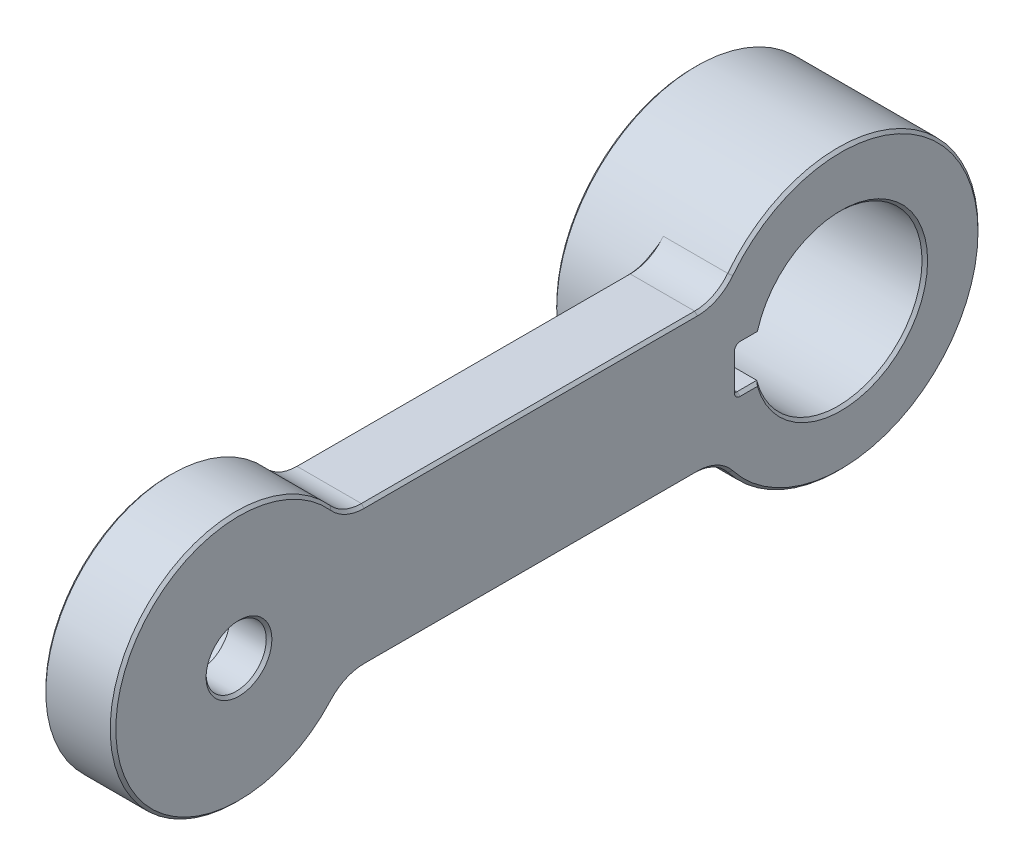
ISO-10303-21;
HEADER;
FILE_DESCRIPTION(('STEP AP214'),'2;1');
FILE_NAME('part.step','',(''),(''),'','','');
FILE_SCHEMA(('AUTOMOTIVE_DESIGN { 1 0 10303 214 1 1 1 1 }'));
ENDSEC;
DATA;
#1=APPLICATION_CONTEXT('core data for automotive mechanical design processes');
#2=APPLICATION_PROTOCOL_DEFINITION('international standard','automotive_design',2000,#1);
#3=PRODUCT_CONTEXT('',#1,'mechanical');
#4=PRODUCT('Part','Part','',(#3));
#5=PRODUCT_RELATED_PRODUCT_CATEGORY('part','',(#4));
#6=PRODUCT_DEFINITION_FORMATION('','',#4);
#7=PRODUCT_DEFINITION_CONTEXT('part definition',#1,'design');
#8=PRODUCT_DEFINITION('design','',#6,#7);
#9=PRODUCT_DEFINITION_SHAPE('','',#8);
#10=(LENGTH_UNIT() NAMED_UNIT(*) SI_UNIT(.MILLI.,.METRE.));
#11=(NAMED_UNIT(*) PLANE_ANGLE_UNIT() SI_UNIT($,.RADIAN.));
#12=(NAMED_UNIT(*) SI_UNIT($,.STERADIAN.) SOLID_ANGLE_UNIT());
#13=UNCERTAINTY_MEASURE_WITH_UNIT(LENGTH_MEASURE(1.E-05),#10,'distance_accuracy_value','');
#14=(GEOMETRIC_REPRESENTATION_CONTEXT(3) GLOBAL_UNCERTAINTY_ASSIGNED_CONTEXT((#13)) GLOBAL_UNIT_ASSIGNED_CONTEXT((#10,
#11,#12)) REPRESENTATION_CONTEXT('',''));
#15=CARTESIAN_POINT('',(0.,0.,0.));
#16=DIRECTION('',(0.,0.,1.));
#17=DIRECTION('',(1.,0.,0.));
#18=AXIS2_PLACEMENT_3D('',#15,#16,#17);
#19=CARTESIAN_POINT('',(-5.6843418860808E-11,0.,43.));
#20=DIRECTION('',(-1.,0.,0.));
#21=DIRECTION('',(0.,0.,1.));
#22=AXIS2_PLACEMENT_3D('',#19,#20,#21);
#23=CONICAL_SURFACE('',#22,3.20000000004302,0.785398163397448);
#24=CARTESIAN_POINT('',(0.2000000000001,0.,43.));
#25=DIRECTION('',(-1.,0.,0.));
#26=DIRECTION('',(0.,0.,1.));
#27=AXIS2_PLACEMENT_3D('',#24,#25,#26);
#28=CIRCLE('',#27,3.);
#29=CARTESIAN_POINT('',(0.2000000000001,0.,46.));
#30=VERTEX_POINT('',#29);
#31=EDGE_CURVE('E225',#30,#30,#28,.F.);
#32=ORIENTED_EDGE('',*,*,#31,.T.);
#33=EDGE_LOOP('',(#32));
#34=FACE_BOUND('',#33,.T.);
#35=CARTESIAN_POINT('',(-5.6843418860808E-11,0.,43.));
#36=DIRECTION('',(-1.,0.,0.));
#37=DIRECTION('',(0.,0.,1.));
#38=AXIS2_PLACEMENT_3D('',#35,#36,#37);
#39=CIRCLE('',#38,3.20000000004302);
#40=CARTESIAN_POINT('',(-5.6843418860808E-11,0.,46.200000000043));
#41=VERTEX_POINT('',#40);
#42=EDGE_CURVE('E319',#41,#41,#39,.T.);
#43=ORIENTED_EDGE('',*,*,#42,.T.);
#44=EDGE_LOOP('',(#43));
#45=FACE_BOUND('',#44,.T.);
#46=ADVANCED_FACE('F16',(#34,#45),#23,.F.);
#47=CARTESIAN_POINT('',(-5.4,-1.6,6.504737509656));
#48=DIRECTION('',(-0.707106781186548,0.707106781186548,0.));
#49=DIRECTION('',(-0.707106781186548,-0.707106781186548,0.));
#50=AXIS2_PLACEMENT_3D('',#47,#48,#49);
#51=PLANE('',#50);
#52=CARTESIAN_POINT('',(-34709.7658594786,-34705.9658594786,-0.000376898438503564));
#53=DIRECTION('',(-0.707106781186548,0.707106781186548,0.));
#54=DIRECTION('',(-0.707106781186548,-0.707106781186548,0.));
#55=AXIS2_PLACEMENT_3D('',#52,#53,#54);
#56=ELLIPSE('',#55,49084.8297320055,395.211370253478);
#57=CARTESIAN_POINT('',(-5.3000499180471,-1.49996290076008,5.80936819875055));
#58=VERTEX_POINT('',#57);
#59=CARTESIAN_POINT('',(-5.49999999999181,-1.7,5.96200553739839));
#60=VERTEX_POINT('',#59);
#61=EDGE_CURVE('E181',#58,#60,#56,.F.);
#62=ORIENTED_EDGE('',*,*,#61,.T.);
#63=DIRECTION('',(0.,0.,-1.));
#64=VECTOR('',#63,1.);
#65=CARTESIAN_POINT('',(-5.5,-1.7,0.));
#66=LINE('',#65,#64);
#67=CARTESIAN_POINT('',(-5.5,-1.69999999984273,7.19998514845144));
#68=VERTEX_POINT('',#67);
#69=EDGE_CURVE('E180',#68,#60,#66,.T.);
#70=ORIENTED_EDGE('',*,*,#69,.F.);
#71=CARTESIAN_POINT('',(-5.50000775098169,-1.70000775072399,7.19998514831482));
#72=CARTESIAN_POINT('',(-5.49167442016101,-1.69167441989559,7.19998607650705));
#73=CARTESIAN_POINT('',(-5.48334108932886,-1.68334108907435,7.19998696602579));
#74=CARTESIAN_POINT('',(-5.46667442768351,-1.66667442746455,7.19998866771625));
#75=CARTESIAN_POINT('',(-5.45834109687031,-1.658341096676,7.19998947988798));
#76=CARTESIAN_POINT('',(-5.4416744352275,-1.64167443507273,7.19999102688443));
#77=CARTESIAN_POINT('',(-5.43334110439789,-1.63334110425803,7.19999176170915));
#78=CARTESIAN_POINT('',(-5.41667444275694,-1.61667444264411,7.19999315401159));
#79=CARTESIAN_POINT('',(-5.4083411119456,-1.6083411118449,7.19999381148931));
#80=CARTESIAN_POINT('',(-5.3916744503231,-1.59167445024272,7.19999504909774));
#81=CARTESIAN_POINT('',(-5.38334111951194,-1.58334111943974,7.19999562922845));
#82=CARTESIAN_POINT('',(-5.36667445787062,-1.56667445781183,7.19999671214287));
#83=CARTESIAN_POINT('',(-5.35834112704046,-1.5583411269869,7.19999721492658));
#84=CARTESIAN_POINT('',(-5.34167446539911,-1.54167446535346,7.19999814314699));
#85=CARTESIAN_POINT('',(-5.33334113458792,-1.53334113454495,7.1999985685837));
#86=CARTESIAN_POINT('',(-5.31667447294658,-1.51667447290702,7.1999993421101));
#87=CARTESIAN_POINT('',(-5.30834114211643,-1.50834114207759,7.1999996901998));
#88=CARTESIAN_POINT('',(-5.30000781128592,-1.50000781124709,7.19999999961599));
#89=B_SPLINE_CURVE_WITH_KNOTS('',3,(#71,#72,#73,#74,#75,#76,#77,#78,#79,#80,#81,#82,#83,#84,#85,
#86,#87,#88),.UNSPECIFIED.,.F.,.F.,(4,2,2,2,2,2,2,2,4),(0.,0.0353553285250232,
0.0707106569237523,0.10606598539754,0.141421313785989,0.176776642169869,0.21213197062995,
0.247487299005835,0.282842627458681),.UNSPECIFIED.);
#90=CARTESIAN_POINT('',(-5.30000841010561,-1.50000325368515,7.19999999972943));
#91=VERTEX_POINT('',#90);
#92=EDGE_CURVE('E220',#68,#91,#89,.T.);
#93=ORIENTED_EDGE('',*,*,#92,.T.);
#94=DIRECTION('',(0.,0.,-1.));
#95=VECTOR('',#94,1.);
#96=CARTESIAN_POINT('',(-5.3,-1.5,7.4));
#97=LINE('',#96,#95);
#98=EDGE_CURVE('E212',#91,#58,#97,.T.);
#99=ORIENTED_EDGE('',*,*,#98,.T.);
#100=EDGE_LOOP('',(#62,#70,#93,#99));
#101=FACE_BOUND('',#100,.T.);
#102=ADVANCED_FACE('F208',(#101),#51,.T.);
#103=CARTESIAN_POINT('',(-5.4,1.6,6.504737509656));
#104=DIRECTION('',(-0.707106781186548,-0.707106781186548,0.));
#105=DIRECTION('',(0.707106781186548,-0.707106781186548,0.));
#106=AXIS2_PLACEMENT_3D('',#103,#104,#105);
#107=PLANE('',#106);
#108=CARTESIAN_POINT('',(-34709.0199491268,34705.2199491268,-0.000376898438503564));
#109=DIRECTION('',(-0.707106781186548,-0.707106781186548,0.));
#110=DIRECTION('',(-0.707106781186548,0.707106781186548,0.));
#111=AXIS2_PLACEMENT_3D('',#108,#109,#110);
#112=ELLIPSE('',#111,49083.7749238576,395.202877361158);
#113=CARTESIAN_POINT('',(-5.49999999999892,1.6999999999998,5.9619779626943));
#114=VERTEX_POINT('',#113);
#115=CARTESIAN_POINT('',(-5.29995379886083,1.4999772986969,5.8092629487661));
#116=VERTEX_POINT('',#115);
#117=EDGE_CURVE('E284',#114,#116,#112,.F.);
#118=ORIENTED_EDGE('',*,*,#117,.T.);
#119=DIRECTION('',(0.,0.,1.));
#120=VECTOR('',#119,1.);
#121=CARTESIAN_POINT('',(-5.3,1.5,3.4));
#122=LINE('',#121,#120);
#123=CARTESIAN_POINT('',(-5.30000628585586,1.50000356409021,7.20001134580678));
#124=VERTEX_POINT('',#123);
#125=EDGE_CURVE('E176',#116,#124,#122,.T.);
#126=ORIENTED_EDGE('',*,*,#125,.T.);
#127=DIRECTION('',(0.707106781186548,-0.707106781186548,0.));
#128=VECTOR('',#127,1.);
#129=CARTESIAN_POINT('',(-5.4,1.6,7.20002793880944));
#130=LINE('',#129,#128);
#131=CARTESIAN_POINT('',(-5.49999999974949,1.69999999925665,7.20003143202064));
#132=VERTEX_POINT('',#131);
#133=EDGE_CURVE('E168',#124,#132,#130,.F.);
#134=ORIENTED_EDGE('',*,*,#133,.T.);
#135=DIRECTION('',(0.,0.,1.));
#136=VECTOR('',#135,1.);
#137=CARTESIAN_POINT('',(-5.5,1.7,0.));
#138=LINE('',#137,#136);
#139=EDGE_CURVE('E173',#114,#132,#138,.T.);
#140=ORIENTED_EDGE('',*,*,#139,.F.);
#141=EDGE_LOOP('',(#118,#126,#134,#140));
#142=FACE_BOUND('',#141,.T.);
#143=ADVANCED_FACE('F171',(#142),#107,.T.);
#144=CARTESIAN_POINT('',(-5.49999999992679,1.3,7.2));
#145=DIRECTION('',(-1.,0.,0.));
#146=DIRECTION('',(0.,0.,1.));
#147=AXIS2_PLACEMENT_3D('',#144,#145,#146);
#148=CONICAL_SURFACE('',#147,0.399999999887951,0.78539816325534);
#149=CARTESIAN_POINT('',(-5.29999999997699,1.3,7.2));
#150=DIRECTION('',(-1.,0.,0.));
#151=DIRECTION('',(0.,0.,1.));
#152=AXIS2_PLACEMENT_3D('',#149,#150,#151);
#153=CIRCLE('',#152,0.199999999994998);
#154=CARTESIAN_POINT('',(-5.2999999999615,1.2999999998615,7.39999999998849));
#155=VERTEX_POINT('',#154);
#156=EDGE_CURVE('E271',#124,#155,#153,.F.);
#157=ORIENTED_EDGE('',*,*,#156,.T.);
#158=DIRECTION('',(-0.707106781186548,0.,0.707106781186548));
#159=VECTOR('',#158,1.);
#160=CARTESIAN_POINT('',(-5.4,1.299999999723,7.5));
#161=LINE('',#160,#159);
#162=CARTESIAN_POINT('',(-5.49999999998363,1.2999999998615,7.59999999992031));
#163=VERTEX_POINT('',#162);
#164=EDGE_CURVE('E187',#163,#155,#161,.F.);
#165=ORIENTED_EDGE('',*,*,#164,.F.);
#166=CARTESIAN_POINT('',(-5.49999999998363,1.3,7.2));
#167=DIRECTION('',(-1.,0.,0.));
#168=DIRECTION('',(0.,0.,1.));
#169=AXIS2_PLACEMENT_3D('',#166,#167,#168);
#170=CIRCLE('',#169,0.399999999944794);
#171=EDGE_CURVE('E184',#132,#163,#170,.F.);
#172=ORIENTED_EDGE('',*,*,#171,.F.);
#173=ORIENTED_EDGE('',*,*,#133,.F.);
#174=EDGE_LOOP('',(#157,#165,#172,#173));
#175=FACE_BOUND('',#174,.T.);
#176=ADVANCED_FACE('F185',(#175),#148,.F.);
#177=CARTESIAN_POINT('',(-5.5,0.,0.));
#178=DIRECTION('',(-1.,0.,0.));
#179=DIRECTION('',(0.,0.,1.));
#180=AXIS2_PLACEMENT_3D('',#177,#178,#179);
#181=PLANE('',#180);
#182=ORIENTED_EDGE('',*,*,#171,.T.);
#183=DIRECTION('',(0.,1.,0.));
#184=VECTOR('',#183,1.);
#185=CARTESIAN_POINT('',(-5.499999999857,0.,7.599999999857));
#186=LINE('',#185,#184);
#187=CARTESIAN_POINT('',(-5.5,-1.29999999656,7.5999999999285));
#188=VERTEX_POINT('',#187);
#189=EDGE_CURVE('E217',#188,#163,#186,.T.);
#190=ORIENTED_EDGE('',*,*,#189,.F.);
#191=CARTESIAN_POINT('',(-5.5,-1.3,7.2));
#192=DIRECTION('',(-1.,0.,0.));
#193=DIRECTION('',(0.,0.,1.));
#194=AXIS2_PLACEMENT_3D('',#191,#192,#193);
#195=CIRCLE('',#194,0.399999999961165);
#196=EDGE_CURVE('E191',#188,#68,#195,.F.);
#197=ORIENTED_EDGE('',*,*,#196,.T.);
#198=ORIENTED_EDGE('',*,*,#69,.T.);
#199=CARTESIAN_POINT('',(-5.5,-4.835606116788E-05,-0.000376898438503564));
#200=DIRECTION('',(-1.,0.,0.));
#201=DIRECTION('',(0.,0.,1.));
#202=AXIS2_PLACEMENT_3D('',#199,#200,#201);
#203=CIRCLE('',#202,6.19998708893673);
#204=EDGE_CURVE('E197',#60,#114,#203,.F.);
#205=ORIENTED_EDGE('',*,*,#204,.T.);
#206=ORIENTED_EDGE('',*,*,#139,.T.);
#207=EDGE_LOOP('',(#182,#190,#197,#198,#205,#206));
#208=FACE_BOUND('',#207,.T.);
#209=CARTESIAN_POINT('',(-5.50000000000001,0.,0.));
#210=DIRECTION('',(1.,0.,0.));
#211=DIRECTION('',(0.,0.,-1.));
#212=AXIS2_PLACEMENT_3D('',#209,#210,#211);
#213=CIRCLE('',#212,9.80000000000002);
#214=CARTESIAN_POINT('',(-5.50000000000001,0.,-9.80000000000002));
#215=VERTEX_POINT('',#214);
#216=EDGE_CURVE('E228',#215,#215,#213,.T.);
#217=ORIENTED_EDGE('',*,*,#216,.F.);
#218=EDGE_LOOP('',(#217));
#219=FACE_BOUND('',#218,.T.);
#220=ADVANCED_FACE('F193',(#208,#219),#181,.T.);
#221=CARTESIAN_POINT('',(-5.50120779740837,-1.3,7.2));
#222=DIRECTION('',(-1.,0.,0.));
#223=DIRECTION('',(0.,0.,1.));
#224=AXIS2_PLACEMENT_3D('',#221,#222,#223);
#225=CONICAL_SURFACE('',#224,0.401207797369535,0.785398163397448);
#226=CARTESIAN_POINT('',(-5.30000000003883,-1.3,7.2));
#227=DIRECTION('',(-1.,0.,0.));
#228=DIRECTION('',(0.,0.,1.));
#229=AXIS2_PLACEMENT_3D('',#226,#227,#228);
#230=CIRCLE('',#229,0.2);
#231=CARTESIAN_POINT('',(-5.29999999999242,-1.29999999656,7.4));
#232=VERTEX_POINT('',#231);
#233=EDGE_CURVE('E224',#232,#91,#230,.F.);
#234=ORIENTED_EDGE('',*,*,#233,.T.);
#235=ORIENTED_EDGE('',*,*,#92,.F.);
#236=ORIENTED_EDGE('',*,*,#196,.F.);
#237=DIRECTION('',(-0.707106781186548,0.,0.707106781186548));
#238=VECTOR('',#237,1.);
#239=CARTESIAN_POINT('',(-5.4,-1.29999999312,7.5));
#240=LINE('',#239,#238);
#241=EDGE_CURVE('E773',#232,#188,#240,.T.);
#242=ORIENTED_EDGE('',*,*,#241,.F.);
#243=EDGE_LOOP('',(#234,#235,#236,#242));
#244=FACE_BOUND('',#243,.T.);
#245=ADVANCED_FACE('F222',(#244),#225,.F.);
#246=CARTESIAN_POINT('',(0.,0.,43.));
#247=DIRECTION('',(-1.,0.,0.));
#248=DIRECTION('',(0.,0.,1.));
#249=AXIS2_PLACEMENT_3D('',#246,#247,#248);
#250=CYLINDRICAL_SURFACE('',#249,3.);
#251=CARTESIAN_POINT('',(2.2,0.,43.));
#252=DIRECTION('',(-1.,0.,0.));
#253=DIRECTION('',(0.,0.,1.));
#254=AXIS2_PLACEMENT_3D('',#251,#252,#253);
#255=CIRCLE('',#254,3.);
#256=CARTESIAN_POINT('',(2.2,0.,46.));
#257=VERTEX_POINT('',#256);
#258=EDGE_CURVE('E257',#257,#257,#255,.F.);
#259=ORIENTED_EDGE('',*,*,#258,.T.);
#260=EDGE_LOOP('',(#259));
#261=FACE_BOUND('',#260,.T.);
#262=ORIENTED_EDGE('',*,*,#31,.F.);
#263=EDGE_LOOP('',(#262));
#264=FACE_BOUND('',#263,.T.);
#265=ADVANCED_FACE('F248',(#261,#264),#250,.F.);
#266=CARTESIAN_POINT('',(-5.29999999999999,0.,0.));
#267=DIRECTION('',(1.,0.,0.));
#268=DIRECTION('',(0.,0.,-1.));
#269=AXIS2_PLACEMENT_3D('',#266,#267,#268);
#270=CONICAL_SURFACE('',#269,9.99999999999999,0.785398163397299);
#271=CARTESIAN_POINT('',(-5.3,0.,0.));
#272=DIRECTION('',(1.,0.,0.));
#273=DIRECTION('',(0.,0.,-1.));
#274=AXIS2_PLACEMENT_3D('',#271,#272,#273);
#275=CIRCLE('',#274,10.);
#276=CARTESIAN_POINT('',(-5.3,0.,-10.));
#277=VERTEX_POINT('',#276);
#278=EDGE_CURVE('E253',#277,#277,#275,.T.);
#279=ORIENTED_EDGE('',*,*,#278,.F.);
#280=EDGE_LOOP('',(#279));
#281=FACE_BOUND('',#280,.T.);
#282=ORIENTED_EDGE('',*,*,#216,.T.);
#283=EDGE_LOOP('',(#282));
#284=FACE_BOUND('',#283,.T.);
#285=ADVANCED_FACE('F325',(#281,#284),#270,.T.);
#286=CARTESIAN_POINT('',(0.,0.,0.));
#287=DIRECTION('',(1.,0.,0.));
#288=DIRECTION('',(0.,0.,-1.));
#289=AXIS2_PLACEMENT_3D('',#286,#287,#288);
#290=PLANE('',#289);
#291=ORIENTED_EDGE('',*,*,#42,.F.);
#292=EDGE_LOOP('',(#291));
#293=FACE_BOUND('',#292,.T.);
#294=CARTESIAN_POINT('',(-5.6843418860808E-11,-8.,34.05572809));
#295=DIRECTION('',(-1.,0.,0.));
#296=DIRECTION('',(0.,0.,1.));
#297=AXIS2_PLACEMENT_3D('',#294,#295,#296);
#298=CIRCLE('',#297,3.20000000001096);
#299=CARTESIAN_POINT('',(2.13587806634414E-09,-4.80000000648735,34.05549270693));
#300=VERTEX_POINT('',#299);
#301=CARTESIAN_POINT('',(-2.83046111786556E-11,-5.86666666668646,36.4408672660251));
#302=VERTEX_POINT('',#301);
#303=EDGE_CURVE('E303',#300,#302,#298,.F.);
#304=ORIENTED_EDGE('',*,*,#303,.T.);
#305=CARTESIAN_POINT('',(2.34187669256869E-13,1.6697724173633E-13,43.));
#306=DIRECTION('',(1.,0.,0.));
#307=DIRECTION('',(0.,1.,0.));
#308=AXIS2_PLACEMENT_3D('',#305,#306,#307);
#309=CIRCLE('',#308,8.80000000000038);
#310=CARTESIAN_POINT('',(-2.89924378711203E-11,5.86666666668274,36.4408672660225));
#311=VERTEX_POINT('',#310);
#312=EDGE_CURVE('E306',#311,#302,#309,.T.);
#313=ORIENTED_EDGE('',*,*,#312,.F.);
#314=CARTESIAN_POINT('',(-5.6843418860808E-11,8.,34.05572809));
#315=DIRECTION('',(-1.,0.,0.));
#316=DIRECTION('',(0.,0.,1.));
#317=AXIS2_PLACEMENT_3D('',#314,#315,#316);
#318=CIRCLE('',#317,3.20000000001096);
#319=CARTESIAN_POINT('',(-2.84348147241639E-11,4.79999999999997,34.055728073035));
#320=VERTEX_POINT('',#319);
#321=EDGE_CURVE('E310',#311,#320,#318,.F.);
#322=ORIENTED_EDGE('',*,*,#321,.T.);
#323=DIRECTION('',(0.,0.,1.));
#324=VECTOR('',#323,1.);
#325=CARTESIAN_POINT('',(0.,4.79999999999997,22.15133942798));
#326=LINE('',#325,#324);
#327=CARTESIAN_POINT('',(-5.6843418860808E-11,4.79999999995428,10.246950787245));
#328=VERTEX_POINT('',#327);
#329=EDGE_CURVE('E313',#328,#320,#326,.T.);
#330=ORIENTED_EDGE('',*,*,#329,.F.);
#331=CARTESIAN_POINT('',(-5.6843418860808E-11,8.,10.24695076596));
#332=DIRECTION('',(-1.,0.,0.));
#333=DIRECTION('',(0.,0.,1.));
#334=AXIS2_PLACEMENT_3D('',#331,#332,#333);
#335=CIRCLE('',#334,3.20000000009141);
#336=CARTESIAN_POINT('',(-1.52190200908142E-11,5.35559319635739,8.44497611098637));
#337=VERTEX_POINT('',#336);
#338=EDGE_CURVE('E317',#328,#337,#335,.F.);
#339=ORIENTED_EDGE('',*,*,#338,.T.);
#340=CARTESIAN_POINT('',(0.,0.,0.));
#341=DIRECTION('',(1.,0.,0.));
#342=DIRECTION('',(0.,0.,-1.));
#343=AXIS2_PLACEMENT_3D('',#340,#341,#342);
#344=CIRCLE('',#343,10.);
#345=CARTESIAN_POINT('',(-2.8421709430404E-11,-5.35559319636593,8.44497611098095));
#346=VERTEX_POINT('',#345);
#347=EDGE_CURVE('E514',#346,#337,#344,.F.);
#348=ORIENTED_EDGE('',*,*,#347,.F.);
#349=CARTESIAN_POINT('',(-5.6843418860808E-11,-8.,10.24695076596));
#350=DIRECTION('',(-1.,0.,0.));
#351=DIRECTION('',(0.,0.,1.));
#352=AXIS2_PLACEMENT_3D('',#349,#350,#351);
#353=CIRCLE('',#352,3.20000000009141);
#354=CARTESIAN_POINT('',(2.13587805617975E-09,-4.80000000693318,10.24719901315));
#355=VERTEX_POINT('',#354);
#356=EDGE_CURVE('E300',#346,#355,#353,.F.);
#357=ORIENTED_EDGE('',*,*,#356,.T.);
#358=DIRECTION('',(0.,0.,1.));
#359=VECTOR('',#358,1.);
#360=CARTESIAN_POINT('',(4.3285995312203E-09,-4.8000000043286,22.15133942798));
#361=LINE('',#360,#359);
#362=EDGE_CURVE('E302',#300,#355,#361,.F.);
#363=ORIENTED_EDGE('',*,*,#362,.F.);
#364=EDGE_LOOP('',(#304,#313,#322,#330,#339,#348,#357,#363));
#365=FACE_BOUND('',#364,.T.);
#366=ADVANCED_FACE('F503',(#293,#365),#290,.F.);
#367=CARTESIAN_POINT('',(5.6843418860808E-11,8.,10.24695076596));
#368=DIRECTION('',(-1.,0.,0.));
#369=DIRECTION('',(0.,0.,1.));
#370=AXIS2_PLACEMENT_3D('',#367,#368,#369);
#371=CONICAL_SURFACE('',#370,3.19999999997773,0.785398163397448);
#372=ORIENTED_EDGE('',*,*,#338,.F.);
#373=DIRECTION('',(-0.707106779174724,-0.707106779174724,-7.54340570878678E-05));
#374=VECTOR('',#373,1.);
#375=CARTESIAN_POINT('',(0.2000000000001,5.0000000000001,10.2469721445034));
#376=LINE('',#375,#374);
#377=CARTESIAN_POINT('',(0.200000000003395,5.00000000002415,10.2469721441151));
#378=VERTEX_POINT('',#377);
#379=EDGE_CURVE('E314',#378,#328,#376,.T.);
#380=ORIENTED_EDGE('',*,*,#379,.F.);
#381=CARTESIAN_POINT('',(0.200000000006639,8.,10.24695076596));
#382=DIRECTION('',(-1.,0.,0.));
#383=DIRECTION('',(0.,0.,1.));
#384=AXIS2_PLACEMENT_3D('',#381,#382,#383);
#385=CIRCLE('',#384,3.00000000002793);
#386=CARTESIAN_POINT('',(0.200000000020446,6.15384617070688,7.8822698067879));
#387=VERTEX_POINT('',#386);
#388=EDGE_CURVE('E872',#378,#387,#385,.F.);
#389=ORIENTED_EDGE('',*,*,#388,.T.);
#390=CARTESIAN_POINT('',(2.65251840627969E-11,5.35559319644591,8.4449761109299));
#391=CARTESIAN_POINT('',(0.0309351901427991,5.42147506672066,8.40320068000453));
#392=CARTESIAN_POINT('',(0.05906696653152,5.48788227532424,8.36000054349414));
#393=CARTESIAN_POINT('',(0.10829575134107,5.62071319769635,8.27126842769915));
#394=CARTESIAN_POINT('',(0.129457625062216,5.68713064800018,8.22576277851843));
#395=CARTESIAN_POINT('',(0.163973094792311,5.82028992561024,8.13208768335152));
#396=CARTESIAN_POINT('',(0.177319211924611,5.88703200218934,8.08391573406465));
#397=CARTESIAN_POINT('',(0.190843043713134,5.98709399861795,8.00977251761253));
#398=CARTESIAN_POINT('',(0.194268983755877,6.0206033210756,7.98461609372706));
#399=CARTESIAN_POINT('',(0.198850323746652,6.08740931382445,7.93380185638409));
#400=CARTESIAN_POINT('',(0.200005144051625,6.12070592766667,7.90814391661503));
#401=CARTESIAN_POINT('',(0.200000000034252,6.15384610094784,7.88226986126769));
#402=B_SPLINE_CURVE_WITH_KNOTS('',3,(#390,#391,#392,#393,#394,#395,#396,#397,#398,#399,#400,
#401),.UNSPECIFIED.,.F.,.F.,(4,2,2,2,2,4),(0.,0.251828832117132,0.501243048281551,
0.750895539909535,0.876961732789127,1.00306009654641),.UNSPECIFIED.);
#403=EDGE_CURVE('E506',#337,#387,#402,.T.);
#404=ORIENTED_EDGE('',*,*,#403,.F.);
#405=EDGE_LOOP('',(#372,#380,#389,#404));
#406=FACE_BOUND('',#405,.T.);
#407=ADVANCED_FACE('F498',(#406),#371,.F.);
#408=CARTESIAN_POINT('',(0.1,4.9,22.15133942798));
#409=DIRECTION('',(-0.707106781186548,0.707106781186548,0.));
#410=DIRECTION('',(-0.707106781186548,-0.707106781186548,0.));
#411=AXIS2_PLACEMENT_3D('',#408,#409,#410);
#412=PLANE('',#411);
#413=CARTESIAN_POINT('',(1.25055521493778E-09,4.80000000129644,34.05572805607));
#414=CARTESIAN_POINT('',(0.00833333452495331,4.80833333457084,34.055728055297));
#415=CARTESIAN_POINT('',(0.0166666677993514,4.81666666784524,34.0557280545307));
#416=CARTESIAN_POINT('',(0.0333333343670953,4.83333333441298,34.0557280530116));
#417=CARTESIAN_POINT('',(0.0416666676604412,4.84166666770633,34.0557280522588));
#418=CARTESIAN_POINT('',(0.0583333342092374,4.85833333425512,34.0557280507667));
#419=CARTESIAN_POINT('',(0.0666666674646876,4.86666666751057,34.0557280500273));
#420=CARTESIAN_POINT('',(0.0833333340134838,4.88333333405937,34.0557280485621));
#421=CARTESIAN_POINT('',(0.0916666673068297,4.89166666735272,34.0557280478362));
#422=CARTESIAN_POINT('',(0.108333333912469,4.90833333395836,34.0557280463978));
#423=CARTESIAN_POINT('',(0.116666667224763,4.91666666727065,34.0557280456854));
#424=CARTESIAN_POINT('',(0.133333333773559,4.93333333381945,34.055728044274));
#425=CARTESIAN_POINT('',(0.141666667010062,4.94166666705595,34.055728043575));
#426=CARTESIAN_POINT('',(0.158333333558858,4.95833333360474,34.0557280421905));
#427=CARTESIAN_POINT('',(0.166666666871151,4.96666666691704,34.055728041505));
#428=CARTESIAN_POINT('',(0.183333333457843,4.98333333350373,34.0557280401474));
#429=CARTESIAN_POINT('',(0.191666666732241,4.99166666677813,34.0557280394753));
#430=CARTESIAN_POINT('',(0.200000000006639,5.00000000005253,34.05572803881));
#431=B_SPLINE_CURVE_WITH_KNOTS('',3,(#413,#414,#415,#416,#417,#418,#419,#420,#421,#422,#423,
#424,#425,#426,#427,#428,#429,#430),.UNSPECIFIED.,.F.,.F.,(4,2,2,2,2,2,2,2,4),(0.,
0.0353553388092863,0.0707106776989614,0.106066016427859,0.141421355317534,0.176776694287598,
0.212132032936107,0.24748737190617,0.282842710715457),.UNSPECIFIED.);
#432=CARTESIAN_POINT('',(0.20000000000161,5.00000000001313,34.05572803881));
#433=VERTEX_POINT('',#432);
#434=EDGE_CURVE('E312',#320,#433,#431,.T.);
#435=ORIENTED_EDGE('',*,*,#434,.T.);
#436=DIRECTION('',(0.,0.,-1.));
#437=VECTOR('',#436,1.);
#438=CARTESIAN_POINT('',(0.2000000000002,5.,8.660254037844));
#439=LINE('',#438,#437);
#440=EDGE_CURVE('E474',#433,#378,#439,.T.);
#441=ORIENTED_EDGE('',*,*,#440,.T.);
#442=ORIENTED_EDGE('',*,*,#379,.T.);
#443=ORIENTED_EDGE('',*,*,#329,.T.);
#444=EDGE_LOOP('',(#435,#441,#442,#443));
#445=FACE_BOUND('',#444,.T.);
#446=ADVANCED_FACE('F494',(#445),#412,.T.);
#447=CARTESIAN_POINT('',(-5.6843418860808E-11,8.,34.05572809));
#448=DIRECTION('',(-1.,0.,0.));
#449=DIRECTION('',(0.,0.,1.));
#450=AXIS2_PLACEMENT_3D('',#447,#448,#449);
#451=CONICAL_SURFACE('',#450,3.20000000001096,0.785398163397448);
#452=ORIENTED_EDGE('',*,*,#321,.F.);
#453=CARTESIAN_POINT('',(0.200000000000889,6.00000001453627,36.2917960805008));
#454=CARTESIAN_POINT('',(0.191666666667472,5.9944444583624,36.2980073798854));
#455=CARTESIAN_POINT('',(0.183333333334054,5.98888890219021,36.3042186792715));
#456=CARTESIAN_POINT('',(0.166666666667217,5.97777778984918,36.3166412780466));
#457=CARTESIAN_POINT('',(0.158333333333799,5.97222223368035,36.3228525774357));
#458=CARTESIAN_POINT('',(0.141666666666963,5.96111112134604,36.3352751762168));
#459=CARTESIAN_POINT('',(0.133333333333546,5.95555556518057,36.3414864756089));
#460=CARTESIAN_POINT('',(0.11666666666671,5.94444445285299,36.3539090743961));
#461=CARTESIAN_POINT('',(0.108333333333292,5.93888889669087,36.3601203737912));
#462=CARTESIAN_POINT('',(0.0916666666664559,5.92777778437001,36.3725429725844));
#463=CARTESIAN_POINT('',(0.0833333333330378,5.92222222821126,36.3787542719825));
#464=CARTESIAN_POINT('',(0.0666666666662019,5.91111111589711,36.3911768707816));
#465=CARTESIAN_POINT('',(0.058333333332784,5.90555555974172,36.3973881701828));
#466=CARTESIAN_POINT('',(0.0416666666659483,5.89444444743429,36.409810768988));
#467=CARTESIAN_POINT('',(0.0333333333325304,5.88888889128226,36.4160220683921));
#468=CARTESIAN_POINT('',(0.0166666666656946,5.87777777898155,36.4284446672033));
#469=CARTESIAN_POINT('',(0.00833333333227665,5.87222222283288,36.4346559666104));
#470=CARTESIAN_POINT('',(-1.14173088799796E-12,5.86666666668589,36.440867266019));
#471=B_SPLINE_CURVE_WITH_KNOTS('',3,(#453,#454,#455,#456,#457,#458,#459,#460,#461,#462,#463,
#464,#465,#466,#467,#468,#469,#470),.UNSPECIFIED.,.F.,.F.,(4,2,2,2,2,2,2,2,4),(0.,
0.0353553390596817,0.0707106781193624,0.106066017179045,0.141421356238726,0.176776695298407,
0.21213203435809,0.247487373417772,0.282842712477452),.UNSPECIFIED.);
#472=CARTESIAN_POINT('',(0.200000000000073,6.00000001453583,36.2917960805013));
#473=VERTEX_POINT('',#472);
#474=EDGE_CURVE('E309',#473,#311,#471,.T.);
#475=ORIENTED_EDGE('',*,*,#474,.F.);
#476=CARTESIAN_POINT('',(0.199999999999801,8.,34.05572809));
#477=DIRECTION('',(1.,0.,0.));
#478=DIRECTION('',(0.,0.,-1.));
#479=AXIS2_PLACEMENT_3D('',#476,#477,#478);
#480=CIRCLE('',#479,3.);
#481=EDGE_CURVE('E462',#473,#433,#480,.T.);
#482=ORIENTED_EDGE('',*,*,#481,.T.);
#483=ORIENTED_EDGE('',*,*,#434,.F.);
#484=EDGE_LOOP('',(#452,#475,#482,#483));
#485=FACE_BOUND('',#484,.T.);
#486=ADVANCED_FACE('F484',(#485),#451,.F.);
#487=CARTESIAN_POINT('',(0.20000000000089,1.669775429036E-13,43.));
#488=DIRECTION('',(1.,0.,0.));
#489=DIRECTION('',(0.,1.,0.));
#490=AXIS2_PLACEMENT_3D('',#487,#488,#489);
#491=CONICAL_SURFACE('',#490,9.00000000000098,0.785398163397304);
#492=CARTESIAN_POINT('',(0.1999999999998,0.,43.));
#493=DIRECTION('',(1.,0.,0.));
#494=DIRECTION('',(0.,0.,-1.));
#495=AXIS2_PLACEMENT_3D('',#492,#493,#494);
#496=CIRCLE('',#495,9.);
#497=CARTESIAN_POINT('',(0.200000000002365,-6.00000000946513,36.2917960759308));
#498=VERTEX_POINT('',#497);
#499=EDGE_CURVE('E432',#473,#498,#496,.T.);
#500=ORIENTED_EDGE('',*,*,#499,.F.);
#501=ORIENTED_EDGE('',*,*,#474,.T.);
#502=ORIENTED_EDGE('',*,*,#312,.T.);
#503=CARTESIAN_POINT('',(-5.6843418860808E-11,-5.86666666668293,36.440867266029));
#504=CARTESIAN_POINT('',(0.00833333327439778,-5.87222222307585,36.4346559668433));
#505=CARTESIAN_POINT('',(0.0166666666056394,-5.87777777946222,36.4284446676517));
#506=CARTESIAN_POINT('',(0.0333333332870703,-5.88888889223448,36.4160220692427));
#507=CARTESIAN_POINT('',(0.0416666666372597,-5.89444444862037,36.4098107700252));
#508=CARTESIAN_POINT('',(0.058333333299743,-5.90555556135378,36.3973881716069));
#509=CARTESIAN_POINT('',(0.066666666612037,-5.91111111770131,36.391176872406));
#510=CARTESIAN_POINT('',(0.0833333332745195,-5.92222223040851,36.3787542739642));
#511=CARTESIAN_POINT('',(0.0916666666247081,-5.92777778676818,36.3725429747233));
#512=CARTESIAN_POINT('',(0.108333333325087,-5.93888889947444,36.3601203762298));
#513=CARTESIAN_POINT('',(0.116666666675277,-5.94444445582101,36.3539090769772));
#514=CARTESIAN_POINT('',(0.13333333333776,-5.95555556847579,36.3414864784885));
#515=CARTESIAN_POINT('',(0.141666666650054,-5.96111112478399,36.3352751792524));
#516=CARTESIAN_POINT('',(0.158333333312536,-5.97222223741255,36.3228525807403));
#517=CARTESIAN_POINT('',(0.166666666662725,-5.97777779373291,36.3166412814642));
#518=CARTESIAN_POINT('',(0.183333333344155,-5.98888890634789,36.3042186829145));
#519=CARTESIAN_POINT('',(0.191666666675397,-5.99444446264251,36.2980073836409));
#520=CARTESIAN_POINT('',(0.200000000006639,-6.00000001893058,36.2917960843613));
#521=B_SPLINE_CURVE_WITH_KNOTS('',3,(#503,#504,#505,#506,#507,#508,#509,#510,#511,#512,#513,
#514,#515,#516,#517,#518,#519,#520),.UNSPECIFIED.,.F.,.F.,(4,2,2,2,2,2,2,2,4),(0.,
0.0353553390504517,0.0707106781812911,0.106066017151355,0.141421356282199,0.176776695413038,
0.212132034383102,0.247487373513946,0.282842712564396),.UNSPECIFIED.);
#522=EDGE_CURVE('E305',#302,#498,#521,.T.);
#523=ORIENTED_EDGE('',*,*,#522,.T.);
#524=EDGE_LOOP('',(#500,#501,#502,#523));
#525=FACE_BOUND('',#524,.T.);
#526=ADVANCED_FACE('F450',(#525),#491,.T.);
#527=CARTESIAN_POINT('',(-5.6843418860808E-11,-8.,34.05572809));
#528=DIRECTION('',(-1.,0.,0.));
#529=DIRECTION('',(0.,0.,1.));
#530=AXIS2_PLACEMENT_3D('',#527,#528,#529);
#531=CONICAL_SURFACE('',#530,3.20000000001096,0.785398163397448);
#532=ORIENTED_EDGE('',*,*,#303,.F.);
#533=DIRECTION('',(-0.707106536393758,0.707106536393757,-0.000832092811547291));
#534=VECTOR('',#533,1.);
#535=CARTESIAN_POINT('',(0.1999934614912,-4.9999934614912,34.0557280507));
#536=LINE('',#535,#534);
#537=CARTESIAN_POINT('',(0.200000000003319,-5.,34.05572807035));
#538=VERTEX_POINT('',#537);
#539=EDGE_CURVE('E424',#538,#300,#536,.T.);
#540=ORIENTED_EDGE('',*,*,#539,.F.);
#541=CARTESIAN_POINT('',(0.200000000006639,-8.,34.05572809));
#542=DIRECTION('',(-1.,0.,0.));
#543=DIRECTION('',(0.,0.,1.));
#544=AXIS2_PLACEMENT_3D('',#541,#542,#543);
#545=CIRCLE('',#544,2.99999999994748);
#546=EDGE_CURVE('E435',#538,#498,#545,.F.);
#547=ORIENTED_EDGE('',*,*,#546,.T.);
#548=ORIENTED_EDGE('',*,*,#522,.F.);
#549=EDGE_LOOP('',(#532,#540,#547,#548));
#550=FACE_BOUND('',#549,.T.);
#551=ADVANCED_FACE('F447',(#550),#531,.F.);
#552=CARTESIAN_POINT('',(0.1,-4.9,22.15133942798));
#553=DIRECTION('',(-0.707106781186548,-0.707106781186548,0.));
#554=DIRECTION('',(0.707106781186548,-0.707106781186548,0.));
#555=AXIS2_PLACEMENT_3D('',#552,#553,#554);
#556=PLANE('',#555);
#557=CARTESIAN_POINT('',(-5.6843418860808E-11,-4.80000000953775,10.24719901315));
#558=CARTESIAN_POINT('',(0.00833306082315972,-4.80833306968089,10.2471891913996));
#559=CARTESIAN_POINT('',(0.0166661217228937,-4.81666612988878,10.2471794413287));
#560=CARTESIAN_POINT('',(0.033332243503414,-4.8333322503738,10.2471600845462));
#561=CARTESIAN_POINT('',(0.0416653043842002,-4.84166531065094,10.2471504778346));
#562=CARTESIAN_POINT('',(0.0583314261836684,-4.85833143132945,10.2471314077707));
#563=CARTESIAN_POINT('',(0.0666644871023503,-4.86666449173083,10.2471219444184));
#564=CARTESIAN_POINT('',(0.0833306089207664,-4.88333061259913,10.2471031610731));
#565=CARTESIAN_POINT('',(0.0916636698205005,-4.89166367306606,10.2470938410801));
#566=CARTESIAN_POINT('',(0.108329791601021,-4.90832979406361,10.2470753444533));
#567=CARTESIAN_POINT('',(0.116662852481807,-4.91666285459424,10.2470661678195));
#568=CARTESIAN_POINT('',(0.133328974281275,-4.93332897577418,10.2470479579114));
#569=CARTESIAN_POINT('',(0.141662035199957,-4.9416620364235,10.2470389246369));
#570=CARTESIAN_POINT('',(0.158328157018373,-4.95832815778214,10.2470210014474));
#571=CARTESIAN_POINT('',(0.166661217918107,-4.96666121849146,10.2470121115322));
#572=CARTESIAN_POINT('',(0.183327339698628,-4.98332733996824,10.2469944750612));
#573=CARTESIAN_POINT('',(0.191660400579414,-4.99166040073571,10.2469857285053));
#574=CARTESIAN_POINT('',(0.199993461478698,-4.9999934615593,10.2469770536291));
#575=B_SPLINE_CURVE_WITH_KNOTS('',3,(#557,#558,#559,#560,#561,#562,#563,#564,#565,#566,#567,
#568,#569,#570,#571,#572,#573,#574),.UNSPECIFIED.,.F.,.F.,(4,2,2,2,2,2,2,2,4),(0.,
0.0353541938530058,0.0707083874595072,0.106062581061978,0.141416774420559,0.176770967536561,
0.212125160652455,0.247479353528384,0.282833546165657),.UNSPECIFIED.);
#576=CARTESIAN_POINT('',(0.199995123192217,-4.99999727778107,10.2469770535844));
#577=VERTEX_POINT('',#576);
#578=EDGE_CURVE('E297',#355,#577,#575,.T.);
#579=ORIENTED_EDGE('',*,*,#578,.T.);
#580=DIRECTION('',(0.,0.,1.));
#581=VECTOR('',#580,1.);
#582=CARTESIAN_POINT('',(0.199999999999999,-5.,35.51668522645));
#583=LINE('',#582,#581);
#584=EDGE_CURVE('E585',#577,#538,#583,.T.);
#585=ORIENTED_EDGE('',*,*,#584,.T.);
#586=ORIENTED_EDGE('',*,*,#539,.T.);
#587=ORIENTED_EDGE('',*,*,#362,.T.);
#588=EDGE_LOOP('',(#579,#585,#586,#587));
#589=FACE_BOUND('',#588,.T.);
#590=ADVANCED_FACE('F446',(#589),#556,.T.);
#591=CARTESIAN_POINT('',(5.6843418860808E-11,-8.,10.24695076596));
#592=DIRECTION('',(-1.,0.,0.));
#593=DIRECTION('',(0.,0.,1.));
#594=AXIS2_PLACEMENT_3D('',#591,#592,#593);
#595=CONICAL_SURFACE('',#594,3.19999999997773,0.785398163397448);
#596=CARTESIAN_POINT('',(0.20000000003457,-8.,10.24695076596));
#597=DIRECTION('',(-1.,0.,0.));
#598=DIRECTION('',(0.,0.,1.));
#599=AXIS2_PLACEMENT_3D('',#596,#597,#598);
#600=CIRCLE('',#599,3.);
#601=CARTESIAN_POINT('',(0.200000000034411,-6.15384617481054,7.88226980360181));
#602=VERTEX_POINT('',#601);
#603=EDGE_CURVE('E588',#602,#577,#600,.F.);
#604=ORIENTED_EDGE('',*,*,#603,.T.);
#605=ORIENTED_EDGE('',*,*,#578,.F.);
#606=ORIENTED_EDGE('',*,*,#356,.F.);
#607=CARTESIAN_POINT('',(0.200000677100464,-6.15384515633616,7.88226852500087));
#608=CARTESIAN_POINT('',(0.200005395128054,-6.12070562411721,7.90814338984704));
#609=CARTESIAN_POINT('',(0.198850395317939,-6.08740928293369,7.93380167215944));
#610=CARTESIAN_POINT('',(0.194268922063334,-6.02060349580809,7.98461616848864));
#611=CARTESIAN_POINT('',(0.19084302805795,-5.98709410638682,8.00977250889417));
#612=CARTESIAN_POINT('',(0.177319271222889,-5.88703199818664,8.0839155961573));
#613=CARTESIAN_POINT('',(0.163973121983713,-5.82028996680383,8.13208761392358));
#614=CARTESIAN_POINT('',(0.129457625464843,-5.68713071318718,8.22576277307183));
#615=CARTESIAN_POINT('',(0.108295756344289,-5.62071324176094,8.27126841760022));
#616=CARTESIAN_POINT('',(0.0590669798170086,-5.48788228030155,8.36000052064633));
#617=CARTESIAN_POINT('',(0.0309352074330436,-5.4214750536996,8.40320064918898));
#618=CARTESIAN_POINT('',(2.69246430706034E-11,-5.3555931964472,8.44497611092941));
#619=B_SPLINE_CURVE_WITH_KNOTS('',3,(#607,#608,#609,#610,#611,#612,#613,#614,#615,#616,#617,
#618),.UNSPECIFIED.,.F.,.F.,(4,2,2,2,2,4),(0.,0.126098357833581,0.252164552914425,
0.501817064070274,0.751231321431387,1.00306018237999),.UNSPECIFIED.);
#620=EDGE_CURVE('E513',#602,#346,#619,.T.);
#621=ORIENTED_EDGE('',*,*,#620,.F.);
#622=EDGE_LOOP('',(#604,#605,#606,#621));
#623=FACE_BOUND('',#622,.T.);
#624=ADVANCED_FACE('F409',(#623),#595,.F.);
#625=CARTESIAN_POINT('',(5.,-1.5,7.4));
#626=DIRECTION('',(0.,-1.,0.));
#627=DIRECTION('',(0.,0.,-1.));
#628=AXIS2_PLACEMENT_3D('',#625,#626,#627);
#629=PLANE('',#628);
#630=ORIENTED_EDGE('',*,*,#98,.F.);
#631=DIRECTION('',(-1.,0.,0.));
#632=VECTOR('',#631,1.);
#633=CARTESIAN_POINT('',(18.6878,-1.5,7.19999999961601));
#634=LINE('',#633,#632);
#635=CARTESIAN_POINT('',(4.79999999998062,-1.49999999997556,7.2000139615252));
#636=VERTEX_POINT('',#635);
#637=EDGE_CURVE('E255',#91,#636,#634,.F.);
#638=ORIENTED_EDGE('',*,*,#637,.T.);
#639=DIRECTION('',(0.,0.,1.));
#640=VECTOR('',#639,1.);
#641=CARTESIAN_POINT('',(4.8,-1.5,7.4));
#642=LINE('',#641,#640);
#643=CARTESIAN_POINT('',(4.79995302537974,-1.49998025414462,5.80926214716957));
#644=VERTEX_POINT('',#643);
#645=EDGE_CURVE('E292',#644,#636,#642,.T.);
#646=ORIENTED_EDGE('',*,*,#645,.F.);
#647=DIRECTION('',(1.,0.,0.));
#648=VECTOR('',#647,1.);
#649=CARTESIAN_POINT('',(4.79995302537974,-1.5,5.80947501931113));
#650=LINE('',#649,#648);
#651=EDGE_CURVE('E397',#644,#58,#650,.F.);
#652=ORIENTED_EDGE('',*,*,#651,.T.);
#653=EDGE_LOOP('',(#630,#638,#646,#652));
#654=FACE_BOUND('',#653,.T.);
#655=ADVANCED_FACE('F405',(#654),#629,.F.);
#656=CARTESIAN_POINT('',(-5.50124393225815,-4.835606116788E-05,-0.000376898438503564));
#657=DIRECTION('',(-1.,0.,0.));
#658=DIRECTION('',(0.,0.,1.));
#659=AXIS2_PLACEMENT_3D('',#656,#657,#658);
#660=CONICAL_SURFACE('',#659,6.20123094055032,0.78536574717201);
#661=ORIENTED_EDGE('',*,*,#204,.F.);
#662=ORIENTED_EDGE('',*,*,#61,.F.);
#663=CARTESIAN_POINT('',(-5.30035281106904,-1.49999108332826,5.80947732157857));
#664=CARTESIAN_POINT('',(-5.30034931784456,-1.6439012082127,5.77233125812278));
#665=CARTESIAN_POINT('',(-5.30034549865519,-1.78642356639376,5.72981805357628));
#666=CARTESIAN_POINT('',(-5.3003372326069,-2.06790544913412,5.63434262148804));
#667=CARTESIAN_POINT('',(-5.30033278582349,-2.20686539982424,5.58138165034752));
#668=CARTESIAN_POINT('',(-5.30032328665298,-2.48050882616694,5.46527046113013));
#669=CARTESIAN_POINT('',(-5.30031823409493,-2.61519108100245,5.40211736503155));
#670=CARTESIAN_POINT('',(-5.30030755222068,-2.87950307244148,5.26598162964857));
#671=CARTESIAN_POINT('',(-5.30030192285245,-3.0091323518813,5.19299810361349));
#672=CARTESIAN_POINT('',(-5.30028932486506,-3.27965407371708,5.02715664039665));
#673=CARTESIAN_POINT('',(-5.30028227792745,-3.41971988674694,4.93294592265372));
#674=CARTESIAN_POINT('',(-5.30026752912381,-3.69147058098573,4.73302377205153));
#675=CARTESIAN_POINT('',(-5.30025982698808,-3.82315197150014,4.62730759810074));
#676=CARTESIAN_POINT('',(-5.30024382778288,-4.07709327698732,4.40519620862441));
#677=CARTESIAN_POINT('',(-5.30023553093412,-4.19935665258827,4.2888049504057));
#678=CARTESIAN_POINT('',(-5.30021839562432,-4.4336888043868,4.04609313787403));
#679=CARTESIAN_POINT('',(-5.30020955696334,-4.54575377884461,3.91976891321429));
#680=CARTESIAN_POINT('',(-5.30019140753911,-4.75879575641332,3.65818318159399));
#681=CARTESIAN_POINT('',(-5.30018209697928,-4.85977747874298,3.52292551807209));
#682=CARTESIAN_POINT('',(-5.30016306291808,-5.05002549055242,3.24433427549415));
#683=CARTESIAN_POINT('',(-5.30015333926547,-5.13928743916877,3.1009977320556));
#684=CARTESIAN_POINT('',(-5.30013355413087,-5.30539417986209,2.80735448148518));
#685=CARTESIAN_POINT('',(-5.30012349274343,-5.38224241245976,2.65704972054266));
#686=CARTESIAN_POINT('',(-5.30010309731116,-5.52303153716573,2.35044467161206));
#687=CARTESIAN_POINT('',(-5.30009276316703,-5.58696765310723,2.19414219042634));
#688=CARTESIAN_POINT('',(-5.30007190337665,-5.7014198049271,1.87676785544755));
#689=CARTESIAN_POINT('',(-5.3000613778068,-5.75194107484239,1.71569788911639));
#690=CARTESIAN_POINT('',(-5.30004020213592,-5.83925343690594,1.38981491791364));
#691=CARTESIAN_POINT('',(-5.30002955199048,-5.8760394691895,1.22500055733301));
#692=CARTESIAN_POINT('',(-5.30000821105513,-5.93558143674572,0.892925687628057));
#693=CARTESIAN_POINT('',(-5.29999752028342,-5.95834304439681,0.725666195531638));
#694=CARTESIAN_POINT('',(-5.29997616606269,-5.9897032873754,0.389765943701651));
#695=CARTESIAN_POINT('',(-5.29996550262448,-5.99829699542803,0.22112472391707));
#696=CARTESIAN_POINT('',(-5.29994428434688,-6.00124476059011,-0.116255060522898));
#697=CARTESIAN_POINT('',(-5.29993372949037,-5.99560109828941,-0.284993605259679));
#698=CARTESIAN_POINT('',(-5.29991280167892,-5.97011905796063,-0.621395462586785));
#699=CARTESIAN_POINT('',(-5.29990242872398,-5.95028067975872,-0.789058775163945));
#700=CARTESIAN_POINT('',(-5.29988193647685,-5.89654501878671,-1.12215049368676));
#701=CARTESIAN_POINT('',(-5.29987181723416,-5.86264501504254,-1.28757846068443));
#702=CARTESIAN_POINT('',(-5.29985190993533,-5.78104118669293,-1.61493280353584));
#703=CARTESIAN_POINT('',(-5.29984212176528,-5.73334216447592,-1.77686037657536));
#704=CARTESIAN_POINT('',(-5.29982293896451,-5.62445468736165,-2.09618115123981));
#705=CARTESIAN_POINT('',(-5.29981354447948,-5.56326128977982,-2.25357266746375));
#706=CARTESIAN_POINT('',(-5.29979522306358,-5.42785536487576,-2.56258292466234));
#707=CARTESIAN_POINT('',(-5.29978629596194,-5.35364763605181,-2.71420376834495));
#708=CARTESIAN_POINT('',(-5.29976896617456,-5.19269841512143,-3.01070539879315));
#709=CARTESIAN_POINT('',(-5.29976056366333,-5.105952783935,-3.15558393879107));
#710=CARTESIAN_POINT('',(-5.29974434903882,-4.92059733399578,-3.43746488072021));
#711=CARTESIAN_POINT('',(-5.29973653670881,-4.82199190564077,-3.57447016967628));
#712=CARTESIAN_POINT('',(-5.29972155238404,-4.61356210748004,-3.83972705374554));
#713=CARTESIAN_POINT('',(-5.29971438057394,-4.50373452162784,-3.96797612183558));
#714=CARTESIAN_POINT('',(-5.29970073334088,-4.27370745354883,-4.21471978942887));
#715=CARTESIAN_POINT('',(-5.29969425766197,-4.15351181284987,-4.33321797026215));
#716=CARTESIAN_POINT('',(-5.29968204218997,-3.9034964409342,-4.55973530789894));
#717=CARTESIAN_POINT('',(-5.29967630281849,-3.77367126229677,-4.66774845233));
#718=CARTESIAN_POINT('',(-5.29966560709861,-3.50543042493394,-4.87241290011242));
#719=CARTESIAN_POINT('',(-5.29966065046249,-3.36701794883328,-4.96906837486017));
#720=CARTESIAN_POINT('',(-5.29965154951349,-3.08243676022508,-5.15044416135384));
#721=CARTESIAN_POINT('',(-5.29964740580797,-2.93626235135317,-5.23515553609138));
#722=CARTESIAN_POINT('',(-5.29963996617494,-2.63734846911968,-5.39192602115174));
#723=CARTESIAN_POINT('',(-5.29963666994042,-2.48461139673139,-5.46398971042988));
#724=CARTESIAN_POINT('',(-5.29963094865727,-2.1737061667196,-5.59494683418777));
#725=CARTESIAN_POINT('',(-5.29962852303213,-2.01554167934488,-5.65384897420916));
#726=CARTESIAN_POINT('',(-5.29962455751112,-1.69486906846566,-5.75811194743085));
#727=CARTESIAN_POINT('',(-5.29962301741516,-1.53236193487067,-5.80347583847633));
#728=CARTESIAN_POINT('',(-5.29962043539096,-1.1442091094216,-5.89437506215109));
#729=CARTESIAN_POINT('',(-5.29961977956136,-0.91713670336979,-5.93394787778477));
#730=CARTESIAN_POINT('',(-5.29962014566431,-0.460081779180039,-5.98675970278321));
#731=CARTESIAN_POINT('',(-5.29962116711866,-0.23010010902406,-6.00000621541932));
#732=CARTESIAN_POINT('',(-5.29962541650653,0.296987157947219,-5.99999197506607));
#733=CARTESIAN_POINT('',(-5.29962920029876,0.594139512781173,-5.97789012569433));
#734=CARTESIAN_POINT('',(-5.29963946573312,1.18208150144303,-5.88992513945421));
#735=CARTESIAN_POINT('',(-5.29964594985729,1.47286502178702,-5.82402170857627));
#736=CARTESIAN_POINT('',(-5.29966252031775,2.07971794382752,-5.63812097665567));
#737=CARTESIAN_POINT('',(-5.29967297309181,2.39394953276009,-5.51205513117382));
#738=CARTESIAN_POINT('',(-5.29969687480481,2.99679906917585,-5.20894433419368));
#739=CARTESIAN_POINT('',(-5.2997103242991,3.28541225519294,-5.03188993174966));
#740=CARTESIAN_POINT('',(-5.2997398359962,3.82880711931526,-4.6318506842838));
#741=CARTESIAN_POINT('',(-5.29975589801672,4.08359115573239,-4.40886904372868));
#742=CARTESIAN_POINT('',(-5.29979017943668,4.55209399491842,-3.92329405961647));
#743=CARTESIAN_POINT('',(-5.29980839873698,4.76581468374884,-3.66070253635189));
#744=CARTESIAN_POINT('',(-5.2998464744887,5.14613604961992,-3.10341105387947));
#745=CARTESIAN_POINT('',(-5.29986633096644,5.31273596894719,-2.80871057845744));
#746=CARTESIAN_POINT('',(-5.29990713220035,5.59412088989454,-2.19533513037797));
#747=CARTESIAN_POINT('',(-5.29992807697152,5.70890517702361,-1.87665982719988));
#748=CARTESIAN_POINT('',(-5.29995983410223,5.83971433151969,-1.38792497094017));
#749=CARTESIAN_POINT('',(-5.29997048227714,5.87643141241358,-1.22313510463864));
#750=CARTESIAN_POINT('',(-5.29999182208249,5.93585694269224,-0.89106541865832));
#751=CARTESIAN_POINT('',(-5.30000251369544,5.95857055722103,-0.723786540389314));
#752=CARTESIAN_POINT('',(-5.3000238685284,5.98982840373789,-0.387861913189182));
#753=CARTESIAN_POINT('',(-5.30003453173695,5.9983675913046,-0.219215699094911));
#754=CARTESIAN_POINT('',(-5.30005574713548,6.0012066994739,0.118137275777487));
#755=CARTESIAN_POINT('',(-5.30006629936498,5.99551187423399,0.286843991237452));
#756=CARTESIAN_POINT('',(-5.30008722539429,5.96992789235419,0.623239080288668));
#757=CARTESIAN_POINT('',(-5.30009759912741,5.95003354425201,0.790927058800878));
#758=CARTESIAN_POINT('',(-5.30011808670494,5.89619676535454,1.12396914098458));
#759=CARTESIAN_POINT('',(-5.30012820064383,5.862259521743,1.28932408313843));
#760=CARTESIAN_POINT('',(-5.30014810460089,5.78056248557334,1.61665177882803));
#761=CARTESIAN_POINT('',(-5.30015789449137,5.7327973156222,1.77862319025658));
#762=CARTESIAN_POINT('',(-5.30017707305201,5.62380950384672,2.09790638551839));
#763=CARTESIAN_POINT('',(-5.3001864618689,5.56259183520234,2.25521986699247));
#764=CARTESIAN_POINT('',(-5.30020477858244,5.42710034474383,2.56418526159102));
#765=CARTESIAN_POINT('',(-5.3002137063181,5.35282200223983,2.71583519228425));
#766=CARTESIAN_POINT('',(-5.30023103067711,5.19178170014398,3.01228254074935));
#767=CARTESIAN_POINT('',(-5.30023942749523,5.1050243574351,3.15708246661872));
#768=CARTESIAN_POINT('',(-5.30025563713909,4.91958549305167,3.43891611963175));
#769=CARTESIAN_POINT('',(-5.30026344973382,4.82089929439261,3.5759467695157));
#770=CARTESIAN_POINT('',(-5.3002784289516,4.61237041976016,3.84115660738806));
#771=CARTESIAN_POINT('',(-5.30028559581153,4.50253186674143,3.96933903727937));
#772=CARTESIAN_POINT('',(-5.30029923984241,4.27238119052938,4.21606876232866));
#773=CARTESIAN_POINT('',(-5.30030571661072,4.15206302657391,4.33461042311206));
#774=CARTESIAN_POINT('',(-5.30031792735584,3.9019118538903,4.56109014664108));
#775=CARTESIAN_POINT('',(-5.300323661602,3.77208232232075,4.66903205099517));
#776=CARTESIAN_POINT('',(-5.30033434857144,3.50380569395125,4.87358046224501));
#777=CARTESIAN_POINT('',(-5.30033930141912,3.36535997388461,4.97018877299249));
#778=CARTESIAN_POINT('',(-5.30034839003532,3.0808800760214,5.15137183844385));
#779=CARTESIAN_POINT('',(-5.30035252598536,2.93484759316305,5.23594926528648));
#780=CARTESIAN_POINT('',(-5.30036131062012,2.58154142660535,5.42112385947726));
#781=CARTESIAN_POINT('',(-5.30036559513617,2.37137540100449,5.51629484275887));
#782=CARTESIAN_POINT('',(-5.30037079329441,2.04925038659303,5.64037480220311));
#783=CARTESIAN_POINT('',(-5.30037232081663,1.94078175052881,5.67860850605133));
#784=CARTESIAN_POINT('',(-5.30037496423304,1.72183732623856,5.74878058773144));
#785=CARTESIAN_POINT('',(-5.30037608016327,1.61136171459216,5.78071951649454));
#786=CARTESIAN_POINT('',(-5.3003769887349,1.50003005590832,5.80946725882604));
#787=B_SPLINE_CURVE_WITH_KNOTS('',3,(#663,#664,#665,#666,#667,#668,#669,#670,#671,#672,#673,
#674,#675,#676,#677,#678,#679,#680,#681,#682,#683,#684,#685,#686,#687,#688,#689,#690,#691,#692,
#693,#694,#695,#696,#697,#698,#699,#700,#701,#702,#703,#704,#705,#706,#707,#708,#709,#710,#711,
#712,#713,#714,#715,#716,#717,#718,#719,#720,#721,#722,#723,#724,#725,#726,#727,#728,#729,#730,
#731,#732,#733,#734,#735,#736,#737,#738,#739,#740,#741,#742,#743,#744,#745,#746,#747,#748,#749,
#750,#751,#752,#753,#754,#755,#756,#757,#758,#759,#760,#761,#762,#763,#764,#765,#766,#767,#768,
#769,#770,#771,#772,#773,#774,#775,#776,#777,#778,#779,#780,#781,#782,#783,#784,#785,#786),
.UNSPECIFIED.,.F.,.F.,(4,2,2,2,2,2,2,2,2,2,2,2,2,2,2,2,2,2,2,2,2,2,2,2,2,2,2,2,2,2,2,2,2,2,2,2,
2,2,2,2,2,2,2,2,2,2,2,2,2,2,2,2,2,2,2,2,2,2,2,2,2,4),(0.,0.445774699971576,0.891495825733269,
1.33734303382,1.7832304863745,2.28902361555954,2.79502596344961,3.30084148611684,
3.80684479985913,4.31263181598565,4.81860564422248,5.32443899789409,5.83045911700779,
6.33628151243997,6.84229006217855,7.34809381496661,7.85407343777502,8.35997201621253,
8.86587060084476,9.37186712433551,9.87768776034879,10.3836939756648,10.8895140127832,
11.3955014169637,11.9013020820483,12.4072481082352,12.9130074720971,13.4190551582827,
13.9249164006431,14.4311541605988,14.9372082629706,15.4429266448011,15.9485307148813,
16.6383959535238,17.328064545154,18.2185426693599,19.1098410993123,20.1206549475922,
21.1316562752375,22.142587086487,23.1534714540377,24.1643720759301,25.175286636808,
25.6812869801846,26.1871005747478,26.6930941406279,27.1989009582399,27.7048927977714,
28.2106978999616,28.7166999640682,29.2225152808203,29.7285060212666,30.2343100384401,
30.7403130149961,31.2461296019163,31.7522397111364,32.2581657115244,32.7640110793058,
33.2697439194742,33.9601307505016,34.3050015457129,34.6498421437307),.UNSPECIFIED.);
#788=EDGE_CURVE('E395',#58,#116,#787,.T.);
#789=ORIENTED_EDGE('',*,*,#788,.T.);
#790=ORIENTED_EDGE('',*,*,#117,.F.);
#791=EDGE_LOOP('',(#661,#662,#789,#790));
#792=FACE_BOUND('',#791,.T.);
#793=ADVANCED_FACE('F399',(#792),#660,.F.);
#794=CARTESIAN_POINT('',(5.,1.5,3.4));
#795=DIRECTION('',(0.,1.,0.));
#796=DIRECTION('',(0.,0.,1.));
#797=AXIS2_PLACEMENT_3D('',#794,#795,#796);
#798=PLANE('',#797);
#799=ORIENTED_EDGE('',*,*,#125,.F.);
#800=DIRECTION('',(1.,0.,0.));
#801=VECTOR('',#800,1.);
#802=CARTESIAN_POINT('',(-5.29995379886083,1.5,5.80947501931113));
#803=LINE('',#802,#801);
#804=CARTESIAN_POINT('',(4.79995422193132,1.49997984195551,5.80927483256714));
#805=VERTEX_POINT('',#804);
#806=EDGE_CURVE('E1163',#116,#805,#803,.T.);
#807=ORIENTED_EDGE('',*,*,#806,.T.);
#808=DIRECTION('',(0.,0.,-1.));
#809=VECTOR('',#808,1.);
#810=CARTESIAN_POINT('',(4.8,1.5,3.4));
#811=LINE('',#810,#809);
#812=CARTESIAN_POINT('',(4.80000235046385,1.50000235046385,7.19999999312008));
#813=VERTEX_POINT('',#812);
#814=EDGE_CURVE('E279',#813,#805,#811,.T.);
#815=ORIENTED_EDGE('',*,*,#814,.F.);
#816=DIRECTION('',(-1.,0.,0.));
#817=VECTOR('',#816,1.);
#818=CARTESIAN_POINT('',(18.6878,1.5,7.19999999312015));
#819=LINE('',#818,#817);
#820=EDGE_CURVE('E273',#813,#124,#819,.T.);
#821=ORIENTED_EDGE('',*,*,#820,.T.);
#822=EDGE_LOOP('',(#799,#807,#815,#821));
#823=FACE_BOUND('',#822,.T.);
#824=ADVANCED_FACE('F404',(#823),#798,.F.);
#825=CARTESIAN_POINT('',(18.6878,1.3,7.2));
#826=DIRECTION('',(-1.,0.,0.));
#827=DIRECTION('',(0.,0.,1.));
#828=AXIS2_PLACEMENT_3D('',#825,#826,#827);
#829=CYLINDRICAL_SURFACE('',#828,0.2);
#830=ORIENTED_EDGE('',*,*,#156,.F.);
#831=ORIENTED_EDGE('',*,*,#820,.F.);
#832=CARTESIAN_POINT('',(4.80000000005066,1.3,7.2));
#833=DIRECTION('',(1.,0.,0.));
#834=DIRECTION('',(0.,0.,-1.));
#835=AXIS2_PLACEMENT_3D('',#832,#833,#834);
#836=CIRCLE('',#835,0.2);
#837=CARTESIAN_POINT('',(4.80000000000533,1.299999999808,7.40000000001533));
#838=VERTEX_POINT('',#837);
#839=EDGE_CURVE('E276',#838,#813,#836,.F.);
#840=ORIENTED_EDGE('',*,*,#839,.F.);
#841=DIRECTION('',(-1.,0.,0.));
#842=VECTOR('',#841,1.);
#843=CARTESIAN_POINT('',(18.6878,1.3,7.4));
#844=LINE('',#843,#842);
#845=EDGE_CURVE('E549',#838,#155,#844,.T.);
#846=ORIENTED_EDGE('',*,*,#845,.T.);
#847=EDGE_LOOP('',(#830,#831,#840,#846));
#848=FACE_BOUND('',#847,.T.);
#849=ADVANCED_FACE('F538',(#848),#829,.F.);
#850=CARTESIAN_POINT('',(-5.4,0.,7.5));
#851=DIRECTION('',(-0.707106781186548,0.,-0.707106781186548));
#852=DIRECTION('',(-0.707106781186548,0.,0.707106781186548));
#853=AXIS2_PLACEMENT_3D('',#850,#851,#852);
#854=PLANE('',#853);
#855=ORIENTED_EDGE('',*,*,#241,.T.);
#856=ORIENTED_EDGE('',*,*,#189,.T.);
#857=ORIENTED_EDGE('',*,*,#164,.T.);
#858=DIRECTION('',(0.,1.,0.));
#859=VECTOR('',#858,1.);
#860=CARTESIAN_POINT('',(-5.299999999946,1.5,7.4));
#861=LINE('',#860,#859);
#862=EDGE_CURVE('E719',#155,#232,#861,.F.);
#863=ORIENTED_EDGE('',*,*,#862,.T.);
#864=EDGE_LOOP('',(#855,#856,#857,#863));
#865=FACE_BOUND('',#864,.T.);
#866=ADVANCED_FACE('F535',(#865),#854,.T.);
#867=CARTESIAN_POINT('',(18.6878,-1.3,7.2));
#868=DIRECTION('',(-1.,0.,0.));
#869=DIRECTION('',(0.,0.,1.));
#870=AXIS2_PLACEMENT_3D('',#867,#868,#869);
#871=CYLINDRICAL_SURFACE('',#870,0.2);
#872=ORIENTED_EDGE('',*,*,#233,.F.);
#873=DIRECTION('',(1.,0.,0.));
#874=VECTOR('',#873,1.);
#875=CARTESIAN_POINT('',(5.,-1.29999999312,7.4));
#876=LINE('',#875,#874);
#877=CARTESIAN_POINT('',(4.79999999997,-1.299999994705,7.39999999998));
#878=VERTEX_POINT('',#877);
#879=EDGE_CURVE('E715',#232,#878,#876,.T.);
#880=ORIENTED_EDGE('',*,*,#879,.T.);
#881=CARTESIAN_POINT('',(4.8,-1.3,7.2));
#882=DIRECTION('',(-1.,0.,0.));
#883=DIRECTION('',(0.,0.,1.));
#884=AXIS2_PLACEMENT_3D('',#881,#882,#883);
#885=CIRCLE('',#884,0.2);
#886=EDGE_CURVE('E264',#636,#878,#885,.T.);
#887=ORIENTED_EDGE('',*,*,#886,.F.);
#888=ORIENTED_EDGE('',*,*,#637,.F.);
#889=EDGE_LOOP('',(#872,#880,#887,#888));
#890=FACE_BOUND('',#889,.T.);
#891=ADVANCED_FACE('F531',(#890),#871,.F.);
#892=CARTESIAN_POINT('',(2.2,0.,0.));
#893=DIRECTION('',(1.,0.,0.));
#894=DIRECTION('',(0.,0.,-1.));
#895=AXIS2_PLACEMENT_3D('',#892,#893,#894);
#896=PLANE('',#895);
#897=CARTESIAN_POINT('',(2.2,0.,43.));
#898=DIRECTION('',(1.,0.,0.));
#899=DIRECTION('',(0.,0.,-1.));
#900=AXIS2_PLACEMENT_3D('',#897,#898,#899);
#901=CIRCLE('',#900,2.15);
#902=CARTESIAN_POINT('',(2.2,0.,40.85));
#903=VERTEX_POINT('',#902);
#904=EDGE_CURVE('E718',#903,#903,#901,.T.);
#905=ORIENTED_EDGE('',*,*,#904,.T.);
#906=EDGE_LOOP('',(#905));
#907=FACE_BOUND('',#906,.T.);
#908=ORIENTED_EDGE('',*,*,#258,.F.);
#909=EDGE_LOOP('',(#908));
#910=FACE_BOUND('',#909,.T.);
#911=ADVANCED_FACE('F525',(#907,#910),#896,.F.);
#912=CARTESIAN_POINT('',(0.,0.,0.));
#913=DIRECTION('',(1.,0.,0.));
#914=DIRECTION('',(0.,0.,-1.));
#915=AXIS2_PLACEMENT_3D('',#912,#913,#914);
#916=CYLINDRICAL_SURFACE('',#915,10.);
#917=ORIENTED_EDGE('',*,*,#278,.T.);
#918=EDGE_LOOP('',(#917));
#919=FACE_BOUND('',#918,.T.);
#920=ORIENTED_EDGE('',*,*,#620,.T.);
#921=ORIENTED_EDGE('',*,*,#347,.T.);
#922=ORIENTED_EDGE('',*,*,#403,.T.);
#923=DIRECTION('',(1.,0.,0.));
#924=VECTOR('',#923,1.);
#925=CARTESIAN_POINT('',(0.,6.15384618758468,7.88226979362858));
#926=LINE('',#925,#924);
#927=CARTESIAN_POINT('',(4.79999999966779,6.15384617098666,7.88226980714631));
#928=VERTEX_POINT('',#927);
#929=EDGE_CURVE('E477',#387,#928,#926,.T.);
#930=ORIENTED_EDGE('',*,*,#929,.T.);
#931=CARTESIAN_POINT('',(4.80000000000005,1.123545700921E-13,-1.412203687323E-13));
#932=DIRECTION('',(-1.,0.,0.));
#933=DIRECTION('',(0.,0.,-1.));
#934=AXIS2_PLACEMENT_3D('',#931,#932,#933);
#935=CIRCLE('',#934,9.99999999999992);
#936=CARTESIAN_POINT('',(4.79999999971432,-6.15384618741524,7.88226979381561));
#937=VERTEX_POINT('',#936);
#938=EDGE_CURVE('E765',#937,#928,#935,.F.);
#939=ORIENTED_EDGE('',*,*,#938,.F.);
#940=DIRECTION('',(1.,0.,0.));
#941=VECTOR('',#940,1.);
#942=CARTESIAN_POINT('',(-19.1878,-6.15384618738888,7.88226979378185));
#943=LINE('',#942,#941);
#944=EDGE_CURVE('E594',#937,#602,#943,.F.);
#945=ORIENTED_EDGE('',*,*,#944,.T.);
#946=EDGE_LOOP('',(#920,#921,#922,#930,#939,#945));
#947=FACE_BOUND('',#946,.T.);
#948=ADVANCED_FACE('F519',(#919,#947),#916,.T.);
#949=CARTESIAN_POINT('',(-19.1878,8.,10.24695076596));
#950=DIRECTION('',(1.,0.,0.));
#951=DIRECTION('',(0.,0.,-1.));
#952=AXIS2_PLACEMENT_3D('',#949,#950,#951);
#953=CYLINDRICAL_SURFACE('',#952,3.);
#954=ORIENTED_EDGE('',*,*,#388,.F.);
#955=DIRECTION('',(0.999999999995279,0.,-3.07279379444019E-06));
#956=VECTOR('',#955,1.);
#957=CARTESIAN_POINT('',(0.199990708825,5.,10.24697214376));
#958=LINE('',#957,#956);
#959=CARTESIAN_POINT('',(4.79999999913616,5.00000000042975,10.24695438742));
#960=VERTEX_POINT('',#959);
#961=EDGE_CURVE('E471',#378,#960,#958,.T.);
#962=ORIENTED_EDGE('',*,*,#961,.T.);
#963=CARTESIAN_POINT('',(4.79999999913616,8.,10.24695076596));
#964=DIRECTION('',(1.,0.,0.));
#965=DIRECTION('',(0.,0.,-1.));
#966=AXIS2_PLACEMENT_3D('',#963,#964,#965);
#967=CIRCLE('',#966,2.99999999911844);
#968=EDGE_CURVE('E700',#960,#928,#967,.T.);
#969=ORIENTED_EDGE('',*,*,#968,.T.);
#970=ORIENTED_EDGE('',*,*,#929,.F.);
#971=EDGE_LOOP('',(#954,#962,#969,#970));
#972=FACE_BOUND('',#971,.T.);
#973=ADVANCED_FACE('F524',(#972),#953,.F.);
#974=CARTESIAN_POINT('',(0.,5.,8.660254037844));
#975=DIRECTION('',(0.,-1.,0.));
#976=DIRECTION('',(0.,0.,-1.));
#977=AXIS2_PLACEMENT_3D('',#974,#975,#976);
#978=PLANE('',#977);
#979=ORIENTED_EDGE('',*,*,#440,.F.);
#980=DIRECTION('',(1.,0.,0.));
#981=VECTOR('',#980,1.);
#982=CARTESIAN_POINT('',(-19.1878,5.,34.05572803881));
#983=LINE('',#982,#981);
#984=CARTESIAN_POINT('',(4.79999999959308,5.00000000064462,34.055728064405));
#985=VERTEX_POINT('',#984);
#986=EDGE_CURVE('E470',#433,#985,#983,.T.);
#987=ORIENTED_EDGE('',*,*,#986,.T.);
#988=DIRECTION('',(0.,0.,1.));
#989=VECTOR('',#988,1.);
#990=CARTESIAN_POINT('',(4.7999999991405,5.0000000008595,22.15133942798));
#991=LINE('',#990,#989);
#992=EDGE_CURVE('E373',#960,#985,#991,.T.);
#993=ORIENTED_EDGE('',*,*,#992,.F.);
#994=ORIENTED_EDGE('',*,*,#961,.F.);
#995=EDGE_LOOP('',(#979,#987,#993,#994));
#996=FACE_BOUND('',#995,.T.);
#997=ADVANCED_FACE('F902',(#996),#978,.F.);
#998=CARTESIAN_POINT('',(-19.1878,8.,34.05572809));
#999=DIRECTION('',(1.,0.,0.));
#1000=DIRECTION('',(0.,0.,-1.));
#1001=AXIS2_PLACEMENT_3D('',#998,#999,#1000);
#1002=CYLINDRICAL_SURFACE('',#1001,3.);
#1003=ORIENTED_EDGE('',*,*,#481,.F.);
#1004=DIRECTION('',(1.,0.,0.));
#1005=VECTOR('',#1004,1.);
#1006=CARTESIAN_POINT('',(0.,6.00000001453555,36.2917960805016));
#1007=LINE('',#1006,#1005);
#1008=CARTESIAN_POINT('',(4.80000000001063,6.00000001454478,36.2917960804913));
#1009=VERTEX_POINT('',#1008);
#1010=EDGE_CURVE('E436',#1009,#473,#1007,.F.);
#1011=ORIENTED_EDGE('',*,*,#1010,.F.);
#1012=CARTESIAN_POINT('',(4.80000000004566,8.,34.05572809));
#1013=DIRECTION('',(1.,0.,0.));
#1014=DIRECTION('',(0.,0.,-1.));
#1015=AXIS2_PLACEMENT_3D('',#1012,#1013,#1014);
#1016=CIRCLE('',#1015,2.99999999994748);
#1017=EDGE_CURVE('E754',#1009,#985,#1016,.T.);
#1018=ORIENTED_EDGE('',*,*,#1017,.T.);
#1019=ORIENTED_EDGE('',*,*,#986,.F.);
#1020=EDGE_LOOP('',(#1003,#1011,#1018,#1019));
#1021=FACE_BOUND('',#1020,.T.);
#1022=ADVANCED_FACE('F903',(#1021),#1002,.F.);
#1023=CARTESIAN_POINT('',(0.,0.,43.));
#1024=DIRECTION('',(1.,0.,0.));
#1025=DIRECTION('',(0.,0.,-1.));
#1026=AXIS2_PLACEMENT_3D('',#1023,#1024,#1025);
#1027=CYLINDRICAL_SURFACE('',#1026,9.);
#1028=CARTESIAN_POINT('',(4.79999999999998,1.669775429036E-13,43.));
#1029=DIRECTION('',(-1.,0.,0.));
#1030=DIRECTION('',(0.,0.,-1.));
#1031=AXIS2_PLACEMENT_3D('',#1028,#1029,#1030);
#1032=CIRCLE('',#1031,8.99999999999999);
#1033=CARTESIAN_POINT('',(4.79999999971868,-6.00000000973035,36.2917960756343));
#1034=VERTEX_POINT('',#1033);
#1035=EDGE_CURVE('E665',#1009,#1034,#1032,.F.);
#1036=ORIENTED_EDGE('',*,*,#1035,.F.);
#1037=ORIENTED_EDGE('',*,*,#1010,.T.);
#1038=ORIENTED_EDGE('',*,*,#499,.T.);
#1039=DIRECTION('',(1.,0.,0.));
#1040=VECTOR('',#1039,1.);
#1041=CARTESIAN_POINT('',(0.,-6.00000001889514,36.291796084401));
#1042=LINE('',#1041,#1040);
#1043=EDGE_CURVE('E865',#498,#1034,#1042,.T.);
#1044=ORIENTED_EDGE('',*,*,#1043,.T.);
#1045=EDGE_LOOP('',(#1036,#1037,#1038,#1044));
#1046=FACE_BOUND('',#1045,.T.);
#1047=ADVANCED_FACE('F905',(#1046),#1027,.T.);
#1048=CARTESIAN_POINT('',(-19.1878,-8.,34.05572809));
#1049=DIRECTION('',(1.,0.,0.));
#1050=DIRECTION('',(0.,0.,-1.));
#1051=AXIS2_PLACEMENT_3D('',#1048,#1049,#1050);
#1052=CYLINDRICAL_SURFACE('',#1051,3.);
#1053=ORIENTED_EDGE('',*,*,#546,.F.);
#1054=DIRECTION('',(1.,0.,0.));
#1055=VECTOR('',#1054,1.);
#1056=CARTESIAN_POINT('',(0.,-5.,34.0557280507));
#1057=LINE('',#1056,#1055);
#1058=CARTESIAN_POINT('',(4.79999999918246,-5.00000000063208,34.055728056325));
#1059=VERTEX_POINT('',#1058);
#1060=EDGE_CURVE('E727',#538,#1059,#1057,.T.);
#1061=ORIENTED_EDGE('',*,*,#1060,.T.);
#1062=CARTESIAN_POINT('',(4.79999999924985,-8.,34.05572809));
#1063=DIRECTION('',(1.,0.,0.));
#1064=DIRECTION('',(0.,0.,-1.));
#1065=AXIS2_PLACEMENT_3D('',#1062,#1063,#1064);
#1066=CIRCLE('',#1065,2.99999999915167);
#1067=EDGE_CURVE('E741',#1059,#1034,#1066,.T.);
#1068=ORIENTED_EDGE('',*,*,#1067,.T.);
#1069=ORIENTED_EDGE('',*,*,#1043,.F.);
#1070=EDGE_LOOP('',(#1053,#1061,#1068,#1069));
#1071=FACE_BOUND('',#1070,.T.);
#1072=ADVANCED_FACE('F864',(#1071),#1052,.F.);
#1073=CARTESIAN_POINT('',(0.,-5.,35.51668522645));
#1074=DIRECTION('',(0.,1.,0.));
#1075=DIRECTION('',(0.,0.,1.));
#1076=AXIS2_PLACEMENT_3D('',#1073,#1074,#1075);
#1077=PLANE('',#1076);
#1078=ORIENTED_EDGE('',*,*,#584,.F.);
#1079=CARTESIAN_POINT('',(0.199991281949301,-5.00000000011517,10.2469770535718));
#1080=CARTESIAN_POINT('',(0.391658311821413,-5.00000000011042,10.2469765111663));
#1081=CARTESIAN_POINT('',(0.583325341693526,-5.00000000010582,10.2469759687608));
#1082=CARTESIAN_POINT('',(0.96665940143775,-5.0000000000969,10.2469748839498));
#1083=CARTESIAN_POINT('',(1.15832643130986,-5.00000000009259,10.2469743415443));
#1084=CARTESIAN_POINT('',(1.54166049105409,-5.00000000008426,10.2469732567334));
#1085=CARTESIAN_POINT('',(1.7333275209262,-5.00000000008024,10.2469727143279));
#1086=CARTESIAN_POINT('',(2.11666158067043,-5.0000000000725,10.2469716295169));
#1087=CARTESIAN_POINT('',(2.30832861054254,-5.00000000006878,10.2469710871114));
#1088=CARTESIAN_POINT('',(2.69166267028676,-5.00000000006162,10.2469700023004));
#1089=CARTESIAN_POINT('',(2.88332970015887,-5.0000000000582,10.2469694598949));
#1090=CARTESIAN_POINT('',(3.2666637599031,-5.00000000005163,10.2469683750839));
#1091=CARTESIAN_POINT('',(3.45833078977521,-5.0000000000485,10.2469678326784));
#1092=CARTESIAN_POINT('',(3.84166484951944,-5.00000000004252,10.2469667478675));
#1093=CARTESIAN_POINT('',(4.03333187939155,-5.00000000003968,10.246966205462));
#1094=CARTESIAN_POINT('',(4.41666593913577,-5.00000000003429,10.246965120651));
#1095=CARTESIAN_POINT('',(4.60833296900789,-5.00000000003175,10.2469645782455));
#1096=CARTESIAN_POINT('',(4.79999999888,-5.00000000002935,10.24696403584));
#1097=B_SPLINE_CURVE_WITH_KNOTS('',3,(#1079,#1080,#1081,#1082,#1083,#1084,#1085,#1086,#1087,
#1088,#1089,#1090,#1091,#1092,#1093,#1094,#1095,#1096),.UNSPECIFIED.,.F.,.F.,(4,2,2,2,2,2,2,2,
4),(0.,0.57500108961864,1.15000217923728,1.72500326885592,2.30000435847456,2.8750054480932,
3.45000653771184,4.02500762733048,4.60000871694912),.UNSPECIFIED.);
#1098=CARTESIAN_POINT('',(4.79999999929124,-5.00000000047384,10.24696403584));
#1099=VERTEX_POINT('',#1098);
#1100=EDGE_CURVE('E577',#577,#1099,#1097,.T.);
#1101=ORIENTED_EDGE('',*,*,#1100,.T.);
#1102=DIRECTION('',(0.,0.,1.));
#1103=VECTOR('',#1102,1.);
#1104=CARTESIAN_POINT('',(4.79999999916,-5.00000000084,22.15133942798));
#1105=LINE('',#1104,#1103);
#1106=EDGE_CURVE('E582',#1059,#1099,#1105,.F.);
#1107=ORIENTED_EDGE('',*,*,#1106,.F.);
#1108=ORIENTED_EDGE('',*,*,#1060,.F.);
#1109=EDGE_LOOP('',(#1078,#1101,#1107,#1108));
#1110=FACE_BOUND('',#1109,.T.);
#1111=ADVANCED_FACE('F579',(#1110),#1077,.F.);
#1112=CARTESIAN_POINT('',(-19.1878,-8.,10.24695076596));
#1113=DIRECTION('',(1.,0.,0.));
#1114=DIRECTION('',(0.,0.,-1.));
#1115=AXIS2_PLACEMENT_3D('',#1112,#1113,#1114);
#1116=CYLINDRICAL_SURFACE('',#1115,3.);
#1117=ORIENTED_EDGE('',*,*,#603,.F.);
#1118=ORIENTED_EDGE('',*,*,#944,.F.);
#1119=CARTESIAN_POINT('',(4.79999999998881,-8.,10.24695076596));
#1120=DIRECTION('',(1.,0.,0.));
#1121=DIRECTION('',(0.,0.,-1.));
#1122=AXIS2_PLACEMENT_3D('',#1119,#1120,#1121);
#1123=CIRCLE('',#1122,2.99999999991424);
#1124=EDGE_CURVE('E592',#937,#1099,#1123,.T.);
#1125=ORIENTED_EDGE('',*,*,#1124,.T.);
#1126=ORIENTED_EDGE('',*,*,#1100,.F.);
#1127=EDGE_LOOP('',(#1117,#1118,#1125,#1126));
#1128=FACE_BOUND('',#1127,.T.);
#1129=ADVANCED_FACE('F381',(#1128),#1116,.F.);
#1130=CARTESIAN_POINT('',(5.,0.,0.));
#1131=DIRECTION('',(1.,0.,0.));
#1132=DIRECTION('',(0.,0.,-1.));
#1133=AXIS2_PLACEMENT_3D('',#1130,#1131,#1132);
#1134=CYLINDRICAL_SURFACE('',#1133,6.);
#1135=ORIENTED_EDGE('',*,*,#788,.F.);
#1136=ORIENTED_EDGE('',*,*,#651,.F.);
#1137=CARTESIAN_POINT('',(4.80037675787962,-1.50003302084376,5.80946649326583));
#1138=CARTESIAN_POINT('',(4.80037556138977,-1.64394346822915,5.77231923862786));
#1139=CARTESIAN_POINT('',(4.80037401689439,-1.78646609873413,5.72980480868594));
#1140=CARTESIAN_POINT('',(4.80037024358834,-2.06794841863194,5.63432686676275));
#1141=CARTESIAN_POINT('',(4.80036801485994,-2.20690853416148,5.58136461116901));
#1142=CARTESIAN_POINT('',(4.80036288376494,-2.48055217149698,5.4652508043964));
#1143=CARTESIAN_POINT('',(4.800359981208,-2.61523447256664,5.4020963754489));
#1144=CARTESIAN_POINT('',(4.80035351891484,-2.87954643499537,5.26595793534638));
#1145=CARTESIAN_POINT('',(4.80034995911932,-3.00917563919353,5.19297303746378));
#1146=CARTESIAN_POINT('',(4.80034168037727,-3.27969647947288,5.02712897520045));
#1147=CARTESIAN_POINT('',(4.80033686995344,-3.41976149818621,4.93291707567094));
#1148=CARTESIAN_POINT('',(4.80032646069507,-3.69151050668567,4.73299263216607));
#1149=CARTESIAN_POINT('',(4.80032086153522,-3.82319100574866,4.62727534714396));
#1150=CARTESIAN_POINT('',(4.8003089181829,-4.07713043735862,4.40516181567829));
#1151=CARTESIAN_POINT('',(4.80030257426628,-4.1993928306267,4.28876952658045));
#1152=CARTESIAN_POINT('',(4.8002891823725,-4.43372293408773,4.04605573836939));
#1153=CARTESIAN_POINT('',(4.80028213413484,-4.54578684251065,3.91973056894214));
#1154=CARTESIAN_POINT('',(4.80026738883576,-4.75882661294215,3.65814304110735));
#1155=CARTESIAN_POINT('',(4.80025969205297,-4.85980719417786,3.52288452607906));
#1156=CARTESIAN_POINT('',(4.80024369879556,-5.05005285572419,3.24429167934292));
#1157=CARTESIAN_POINT('',(4.80023540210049,-5.13931359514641,3.1009543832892));
#1158=CARTESIAN_POINT('',(4.80021827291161,-5.30541785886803,2.80730973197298));
#1159=CARTESIAN_POINT('',(4.8002094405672,-5.38226482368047,2.6570043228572));
#1160=CARTESIAN_POINT('',(4.80019129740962,-5.52305136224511,2.35039808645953));
#1161=CARTESIAN_POINT('',(4.80018198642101,-5.586986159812,2.19409506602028));
#1162=CARTESIAN_POINT('',(4.80016295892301,-5.70143563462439,1.87671976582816));
#1163=CARTESIAN_POINT('',(4.8001532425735,-5.75195554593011,1.71564937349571));
#1164=CARTESIAN_POINT('',(4.80013346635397,-5.83926515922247,1.38976566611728));
#1165=CARTESIAN_POINT('',(4.80012340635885,-5.876049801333,1.22495099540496));
#1166=CARTESIAN_POINT('',(4.80010302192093,-5.93558896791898,0.892875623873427));
#1167=CARTESIAN_POINT('',(4.80009269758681,-5.95834916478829,0.725615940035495));
#1168=CARTESIAN_POINT('',(4.80007185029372,-5.98970657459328,0.3897154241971));
#1169=CARTESIAN_POINT('',(4.80006132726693,-5.99829886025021,0.221074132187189));
#1170=CARTESIAN_POINT('',(4.80004016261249,-6.00124377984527,-0.11630567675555));
#1171=CARTESIAN_POINT('',(4.80002952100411,-5.99559869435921,-0.285044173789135));
#1172=CARTESIAN_POINT('',(4.80000819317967,-5.97011381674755,-0.621445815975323));
#1173=CARTESIAN_POINT('',(4.79999750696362,-5.95027402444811,-0.789108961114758));
#1174=CARTESIAN_POINT('',(4.79997616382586,-5.89653555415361,-1.12220022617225));
#1175=CARTESIAN_POINT('',(4.79996550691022,-5.86263415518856,-1.28762790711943));
#1176=CARTESIAN_POINT('',(4.79994430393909,-5.78102756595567,-1.61498156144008));
#1177=CARTESIAN_POINT('',(4.79993375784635,-5.73332717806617,-1.77690873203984));
#1178=CARTESIAN_POINT('',(4.79991284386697,-5.6244370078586,-2.09622858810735));
#1179=CARTESIAN_POINT('',(4.79990247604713,-5.56324228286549,-2.25361958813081));
#1180=CARTESIAN_POINT('',(4.79988200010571,-5.427833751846,-2.56262870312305));
#1181=CARTESIAN_POINT('',(4.79987189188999,-5.35362474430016,-2.71424892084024));
#1182=CARTESIAN_POINT('',(4.79985199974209,-5.19267302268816,-3.01074919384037));
#1183=CARTESIAN_POINT('',(4.79984221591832,-5.10592616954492,-3.155627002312));
#1184=CARTESIAN_POINT('',(4.79982304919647,-4.9205683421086,-3.43750638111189));
#1185=CARTESIAN_POINT('',(4.79981366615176,-4.8219617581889,-3.57451083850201));
#1186=CARTESIAN_POINT('',(4.79979536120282,-4.61352972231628,-3.83976596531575));
#1187=CARTESIAN_POINT('',(4.79978643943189,-4.50370105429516,-3.96801410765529));
#1188=CARTESIAN_POINT('',(4.79976912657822,-4.27367190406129,-4.21475583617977));
#1189=CARTESIAN_POINT('',(4.7997607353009,-4.15347526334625,-4.33325300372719));
#1190=CARTESIAN_POINT('',(4.79974453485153,-3.90345798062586,-4.55976823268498));
#1191=CARTESIAN_POINT('',(4.79973672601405,-3.77363189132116,-4.66778028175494));
#1192=CARTESIAN_POINT('',(4.79972175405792,-3.50538932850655,-4.87244246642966));
#1193=CARTESIAN_POINT('',(4.79971459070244,-3.36697603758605,-4.96909677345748));
#1194=CARTESIAN_POINT('',(4.79970095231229,-3.08239332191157,-5.15047015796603));
#1195=CARTESIAN_POINT('',(4.79969447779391,-2.93621820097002,-5.23518029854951));
#1196=CARTESIAN_POINT('',(4.79968227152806,-2.63730300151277,-5.39194826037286));
#1197=CARTESIAN_POINT('',(4.79967653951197,-2.48456532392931,-5.4640106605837));
#1198=CARTESIAN_POINT('',(4.79966585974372,-2.17365898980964,-5.59496516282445));
#1199=CARTESIAN_POINT('',(4.7996609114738,-2.01549400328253,-5.65386597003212));
#1200=CARTESIAN_POINT('',(4.7996518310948,-1.6948205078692,-5.7581262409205));
#1201=CARTESIAN_POINT('',(4.79964769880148,-1.53231298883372,-5.80348876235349));
#1202=CARTESIAN_POINT('',(4.79963892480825,-1.14415591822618,-5.89438552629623));
#1203=CARTESIAN_POINT('',(4.79963464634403,-0.91707960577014,-5.93395684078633));
#1204=CARTESIAN_POINT('',(4.79962772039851,-0.460017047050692,-5.98676481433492));
#1205=CARTESIAN_POINT('',(4.79962507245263,-0.23003164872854,-6.0000089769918));
#1206=CARTESIAN_POINT('',(4.79962091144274,0.297059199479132,-5.99998840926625));
#1207=CARTESIAN_POINT('',(4.79961995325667,0.594211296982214,-5.97788299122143));
#1208=CARTESIAN_POINT('',(4.79962083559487,1.18215223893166,-5.88991094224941));
#1209=CARTESIAN_POINT('',(4.79962267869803,1.47293496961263,-5.82400401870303));
#1210=CARTESIAN_POINT('',(4.79962956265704,2.07978565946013,-5.63809599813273));
#1211=CARTESIAN_POINT('',(4.79963499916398,2.39401573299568,-5.51202637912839));
#1212=CARTESIAN_POINT('',(4.79964927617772,2.99686162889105,-5.20890834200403));
#1213=CARTESIAN_POINT('',(4.79965811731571,3.28547268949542,-5.03185047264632));
#1214=CARTESIAN_POINT('',(4.79967895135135,3.82886274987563,-4.63180469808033));
#1215=CARTESIAN_POINT('',(4.79969094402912,4.0836441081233,-4.40881999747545));
#1216=CARTESIAN_POINT('',(4.79971774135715,4.55214111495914,-3.92323938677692));
#1217=CARTESIAN_POINT('',(4.7997325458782,4.76585864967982,-3.66064529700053));
#1218=CARTESIAN_POINT('',(4.79976454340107,5.14617332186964,-3.1033492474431));
#1219=CARTESIAN_POINT('',(4.79978173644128,5.31276970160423,-2.80864677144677));
#1220=CARTESIAN_POINT('',(4.79981803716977,5.59414725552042,-2.19526794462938));
#1221=CARTESIAN_POINT('',(4.79983714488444,5.70892771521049,-1.87659126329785));
#1222=CARTESIAN_POINT('',(4.79986680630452,5.83973099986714,-1.38785483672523));
#1223=CARTESIAN_POINT('',(4.79987686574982,5.87644610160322,-1.22306452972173));
#1224=CARTESIAN_POINT('',(4.79989725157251,5.93586764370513,-0.890994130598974));
#1225=CARTESIAN_POINT('',(4.79990757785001,5.95857924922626,-0.723714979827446));
#1226=CARTESIAN_POINT('',(4.79992842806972,5.98983306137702,-0.387789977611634));
#1227=CARTESIAN_POINT('',(4.79993895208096,5.998370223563,-0.219143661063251));
#1228=CARTESIAN_POINT('',(4.79996011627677,6.00120528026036,0.118209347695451));
#1229=CARTESIAN_POINT('',(4.79997075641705,5.99550842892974,0.286915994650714));
#1230=CARTESIAN_POINT('',(4.79999208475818,5.96992040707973,0.623310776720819));
#1231=CARTESIAN_POINT('',(4.80000277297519,5.95002404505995,0.790998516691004));
#1232=CARTESIAN_POINT('',(4.80002411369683,5.8961832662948,1.12403995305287));
#1233=CARTESIAN_POINT('',(4.80003476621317,5.86224403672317,1.28939448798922));
#1234=CARTESIAN_POINT('',(4.80005596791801,5.78054306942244,1.61672120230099));
#1235=CARTESIAN_POINT('',(4.80006651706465,5.73277595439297,1.77869203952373));
#1236=CARTESIAN_POINT('',(4.80008742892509,5.62378430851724,2.09797392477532));
#1237=CARTESIAN_POINT('',(4.80009779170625,5.56256475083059,2.25528667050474));
#1238=CARTESIAN_POINT('',(4.80011826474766,5.42706955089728,2.56425043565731));
#1239=CARTESIAN_POINT('',(4.80012837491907,5.35278938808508,2.71589947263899));
#1240=CARTESIAN_POINT('',(4.80014826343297,5.19174552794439,3.01234488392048));
#1241=CARTESIAN_POINT('',(4.80015804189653,5.10498644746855,3.15714376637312));
#1242=CARTESIAN_POINT('',(4.80017720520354,4.91954419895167,3.4389751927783));
#1243=CARTESIAN_POINT('',(4.80018658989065,4.82085635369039,3.57600465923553));
#1244=CARTESIAN_POINT('',(4.80020489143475,4.61232429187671,3.84121199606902));
#1245=CARTESIAN_POINT('',(4.8002138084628,4.50248419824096,3.96939310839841));
#1246=CARTESIAN_POINT('',(4.80023112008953,4.27233055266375,4.21612007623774));
#1247=CARTESIAN_POINT('',(4.80023951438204,4.15201095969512,4.3346602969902));
#1248=CARTESIAN_POINT('',(4.80025571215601,3.90185705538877,4.56113702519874));
#1249=CARTESIAN_POINT('',(4.80026351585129,3.77202622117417,4.66907737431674));
#1250=CARTESIAN_POINT('',(4.80027847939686,3.50374713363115,4.87362256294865));
#1251=CARTESIAN_POINT('',(4.80028563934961,3.36530025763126,4.97022920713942));
#1252=CARTESIAN_POINT('',(4.80029926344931,3.08081819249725,5.15140884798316));
#1253=CARTESIAN_POINT('',(4.8003057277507,2.93478469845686,5.23598451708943));
#1254=CARTESIAN_POINT('',(4.80032014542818,2.5814868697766,5.42114933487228));
#1255=CARTESIAN_POINT('',(4.8003277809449,2.37133090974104,5.51631347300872));
#1256=CARTESIAN_POINT('',(4.80033811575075,2.04922183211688,5.64038505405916));
#1257=CARTESIAN_POINT('',(4.80034137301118,1.94075865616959,5.67861627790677));
#1258=CARTESIAN_POINT('',(4.80034750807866,1.72182537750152,5.74878404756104));
#1259=CARTESIAN_POINT('',(4.80035038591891,1.61135545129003,5.78072114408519));
#1260=CARTESIAN_POINT('',(4.80035307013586,1.50002956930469,5.80946738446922));
#1261=B_SPLINE_CURVE_WITH_KNOTS('',3,(#1137,#1138,#1139,#1140,#1141,#1142,#1143,#1144,#1145,
#1146,#1147,#1148,#1149,#1150,#1151,#1152,#1153,#1154,#1155,#1156,#1157,#1158,#1159,#1160,#1161,
#1162,#1163,#1164,#1165,#1166,#1167,#1168,#1169,#1170,#1171,#1172,#1173,#1174,#1175,#1176,#1177,
#1178,#1179,#1180,#1181,#1182,#1183,#1184,#1185,#1186,#1187,#1188,#1189,#1190,#1191,#1192,#1193,
#1194,#1195,#1196,#1197,#1198,#1199,#1200,#1201,#1202,#1203,#1204,#1205,#1206,#1207,#1208,#1209,
#1210,#1211,#1212,#1213,#1214,#1215,#1216,#1217,#1218,#1219,#1220,#1221,#1222,#1223,#1224,#1225,
#1226,#1227,#1228,#1229,#1230,#1231,#1232,#1233,#1234,#1235,#1236,#1237,#1238,#1239,#1240,#1241,
#1242,#1243,#1244,#1245,#1246,#1247,#1248,#1249,#1250,#1251,#1252,#1253,#1254,#1255,#1256,#1257,
#1258,#1259,#1260),.UNSPECIFIED.,.F.,.F.,(4,2,2,2,2,2,2,2,2,2,2,2,2,2,2,2,2,2,2,2,2,2,2,2,2,2,2,
2,2,2,2,2,2,2,2,2,2,2,2,2,2,2,2,2,2,2,2,2,2,2,2,2,2,2,2,2,2,2,2,2,2,4),(0.,0.44577652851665,
0.891499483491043,1.33734850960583,1.78323777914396,2.2890309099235,2.79503325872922,
3.30084877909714,3.80685209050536,4.3126391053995,4.81861293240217,5.32444628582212,
5.83046640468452,6.33628879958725,6.84229734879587,7.34810110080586,7.85408072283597,
8.35997930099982,8.86587788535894,9.37187440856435,9.87769504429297,10.3837012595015,
10.8895212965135,11.3955087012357,11.9013093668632,12.4072553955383,12.9130147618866,
13.4190624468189,13.9249236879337,14.4311614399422,14.9372155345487,15.4429339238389,
15.9485380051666,16.638413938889,17.3280932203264,18.2185713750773,19.1098698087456,
20.1206836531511,21.131684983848,22.1426157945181,23.1535001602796,24.1644007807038,
25.1753153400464,25.6813156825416,26.1871292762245,26.6931228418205,27.1989296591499,
27.7049214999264,28.2107266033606,28.7167286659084,29.2225439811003,29.7285347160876,
30.2343387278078,30.7403417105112,31.2461583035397,31.7522684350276,32.2581944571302,
32.7640398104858,33.269772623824,33.9601237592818,34.3049766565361,34.6497993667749),.UNSPECIFIED.);
#1262=EDGE_CURVE('E371',#644,#805,#1261,.T.);
#1263=ORIENTED_EDGE('',*,*,#1262,.T.);
#1264=ORIENTED_EDGE('',*,*,#806,.F.);
#1265=EDGE_LOOP('',(#1135,#1136,#1263,#1264));
#1266=FACE_BOUND('',#1265,.T.);
#1267=ADVANCED_FACE('F375',(#1266),#1134,.F.);
#1268=CARTESIAN_POINT('',(5.,1.5,7.4));
#1269=DIRECTION('',(0.,0.,1.));
#1270=DIRECTION('',(1.,0.,0.));
#1271=AXIS2_PLACEMENT_3D('',#1268,#1269,#1270);
#1272=PLANE('',#1271);
#1273=ORIENTED_EDGE('',*,*,#862,.F.);
#1274=ORIENTED_EDGE('',*,*,#845,.F.);
#1275=DIRECTION('',(0.,1.,0.));
#1276=VECTOR('',#1275,1.);
#1277=CARTESIAN_POINT('',(4.79999999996,0.,7.39999999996));
#1278=LINE('',#1277,#1276);
#1279=EDGE_CURVE('E710',#878,#838,#1278,.T.);
#1280=ORIENTED_EDGE('',*,*,#1279,.F.);
#1281=ORIENTED_EDGE('',*,*,#879,.F.);
#1282=EDGE_LOOP('',(#1273,#1274,#1280,#1281));
#1283=FACE_BOUND('',#1282,.T.);
#1284=ADVANCED_FACE('F380',(#1283),#1272,.F.);
#1285=CARTESIAN_POINT('',(5.,0.,43.));
#1286=DIRECTION('',(1.,0.,0.));
#1287=DIRECTION('',(0.,0.,-1.));
#1288=AXIS2_PLACEMENT_3D('',#1285,#1286,#1287);
#1289=CYLINDRICAL_SURFACE('',#1288,2.15);
#1290=ORIENTED_EDGE('',*,*,#904,.F.);
#1291=EDGE_LOOP('',(#1290));
#1292=FACE_BOUND('',#1291,.T.);
#1293=CARTESIAN_POINT('',(4.79999999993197,0.,43.));
#1294=DIRECTION('',(1.,0.,0.));
#1295=DIRECTION('',(0.,0.,-1.));
#1296=AXIS2_PLACEMENT_3D('',#1293,#1294,#1295);
#1297=CIRCLE('',#1296,2.14999999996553);
#1298=CARTESIAN_POINT('',(4.79999999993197,0.,40.8500000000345));
#1299=VERTEX_POINT('',#1298);
#1300=EDGE_CURVE('E701',#1299,#1299,#1297,.T.);
#1301=ORIENTED_EDGE('',*,*,#1300,.T.);
#1302=EDGE_LOOP('',(#1301));
#1303=FACE_BOUND('',#1302,.T.);
#1304=ADVANCED_FACE('F1045',(#1292,#1303),#1289,.F.);
#1305=CARTESIAN_POINT('',(4.79999999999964,1.123545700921E-13,-1.4137996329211E-13));
#1306=DIRECTION('',(-1.,0.,0.));
#1307=DIRECTION('',(0.,0.,1.));
#1308=AXIS2_PLACEMENT_3D('',#1305,#1306,#1307);
#1309=CONICAL_SURFACE('',#1308,10.0000000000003,0.785398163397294);
#1310=CARTESIAN_POINT('',(4.99999999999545,-6.0307692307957,7.72462442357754));
#1311=CARTESIAN_POINT('',(4.99166666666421,-6.03589743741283,7.73119298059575));
#1312=CARTESIAN_POINT('',(4.98333333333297,-6.04102564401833,7.73776153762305));
#1313=CARTESIAN_POINT('',(4.96666666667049,-6.05128205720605,7.75089865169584));
#1314=CARTESIAN_POINT('',(4.95833333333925,-6.05641026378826,7.75746720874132));
#1315=CARTESIAN_POINT('',(4.94166666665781,-6.06666667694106,7.77060432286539));
#1316=CARTESIAN_POINT('',(4.93333333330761,-6.07179488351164,7.77717287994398));
#1317=CARTESIAN_POINT('',(4.91666666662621,-6.08205129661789,7.79030999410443));
#1318=CARTESIAN_POINT('',(4.90833333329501,-6.08717950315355,7.7968785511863));
#1319=CARTESIAN_POINT('',(4.89166666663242,-6.09743591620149,7.81001566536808));
#1320=CARTESIAN_POINT('',(4.88333333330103,-6.10256412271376,7.81658422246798));
#1321=CARTESIAN_POINT('',(4.86666666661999,-6.11282053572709,7.82972133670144));
#1322=CARTESIAN_POINT('',(4.85833333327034,-6.11794874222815,7.836289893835));
#1323=CARTESIAN_POINT('',(4.84166666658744,-6.12820515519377,7.84942700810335));
#1324=CARTESIAN_POINT('',(4.8333333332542,-6.13333336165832,7.85599556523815));
#1325=CARTESIAN_POINT('',(4.81666666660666,-6.14358977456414,7.86913267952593));
#1326=CARTESIAN_POINT('',(4.80833333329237,-6.14871798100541,7.8757012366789));
#1327=CARTESIAN_POINT('',(4.79999999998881,-6.15384618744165,7.88226979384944));
#1328=B_SPLINE_CURVE_WITH_KNOTS('',3,(#1310,#1311,#1312,#1313,#1314,#1315,#1316,#1317,#1318,
#1319,#1320,#1321,#1322,#1323,#1324,#1325,#1326,#1327),.UNSPECIFIED.,.F.,.F.,(4,2,2,2,2,2,2,2,
4),(0.,0.0353553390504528,0.0707106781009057,0.106066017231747,0.1414213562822,
0.176776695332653,0.212132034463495,0.247487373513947,0.282842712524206),.UNSPECIFIED.);
#1329=CARTESIAN_POINT('',(4.99999999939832,-6.03076923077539,7.72462442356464));
#1330=VERTEX_POINT('',#1329);
#1331=EDGE_CURVE('E611',#1330,#937,#1328,.T.);
#1332=ORIENTED_EDGE('',*,*,#1331,.T.);
#1333=ORIENTED_EDGE('',*,*,#938,.T.);
#1334=CARTESIAN_POINT('',(4.79999999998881,6.15384618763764,7.88226979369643));
#1335=CARTESIAN_POINT('',(4.80833333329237,6.14871798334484,7.87570123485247));
#1336=CARTESIAN_POINT('',(4.81666666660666,6.14358977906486,7.86913267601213));
#1337=CARTESIAN_POINT('',(4.8333333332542,6.13333337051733,7.85599555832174));
#1338=CARTESIAN_POINT('',(4.84166666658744,6.12820516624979,7.84942699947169));
#1339=CARTESIAN_POINT('',(4.85833333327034,6.1179487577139,7.83628988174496));
#1340=CARTESIAN_POINT('',(4.86666666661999,6.11282055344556,7.82972132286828));
#1341=CARTESIAN_POINT('',(4.88333333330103,6.10256414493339,7.81658420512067));
#1342=CARTESIAN_POINT('',(4.89166666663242,6.09743594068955,7.81001564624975));
#1343=CARTESIAN_POINT('',(4.90833333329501,6.08717953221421,7.79687852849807));
#1344=CARTESIAN_POINT('',(4.91666666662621,6.08205132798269,7.7903099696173));
#1345=CARTESIAN_POINT('',(4.93333333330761,6.07179491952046,7.77717285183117));
#1346=CARTESIAN_POINT('',(4.94166666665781,6.06666671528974,7.7706042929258));
#1347=CARTESIAN_POINT('',(4.95833333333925,6.0564103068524,7.75746717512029));
#1348=CARTESIAN_POINT('',(4.96666666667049,6.05128210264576,7.75089861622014));
#1349=CARTESIAN_POINT('',(4.98333333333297,6.04102569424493,7.73776149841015));
#1350=CARTESIAN_POINT('',(4.99166666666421,6.03589749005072,7.7311929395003));
#1351=CARTESIAN_POINT('',(4.99999999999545,6.03076928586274,7.7246243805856));
#1352=B_SPLINE_CURVE_WITH_KNOTS('',3,(#1334,#1335,#1336,#1337,#1338,#1339,#1340,#1341,#1342,
#1343,#1344,#1345,#1346,#1347,#1348,#1349,#1350,#1351),.UNSPECIFIED.,.F.,.F.,(4,2,2,2,2,2,2,2,
4),(0.,0.0353553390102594,0.070710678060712,0.106066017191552,0.141421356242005,
0.176776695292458,0.2121320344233,0.247487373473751,0.282842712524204),.UNSPECIFIED.);
#1353=CARTESIAN_POINT('',(4.999999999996,6.03076925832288,7.72462440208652));
#1354=VERTEX_POINT('',#1353);
#1355=EDGE_CURVE('E695',#928,#1354,#1352,.T.);
#1356=ORIENTED_EDGE('',*,*,#1355,.T.);
#1357=CARTESIAN_POINT('',(4.99999999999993,1.123545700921E-13,-1.4137996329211E-13));
#1358=DIRECTION('',(-1.,0.,0.));
#1359=DIRECTION('',(0.,0.,1.));
#1360=AXIS2_PLACEMENT_3D('',#1357,#1358,#1359);
#1361=CIRCLE('',#1360,9.8000000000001);
#1362=EDGE_CURVE('E709',#1330,#1354,#1361,.F.);
#1363=ORIENTED_EDGE('',*,*,#1362,.F.);
#1364=EDGE_LOOP('',(#1332,#1333,#1356,#1363));
#1365=FACE_BOUND('',#1364,.T.);
#1366=ADVANCED_FACE('F845',(#1365),#1309,.T.);
#1367=CARTESIAN_POINT('',(4.99999999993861,8.,10.24695076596));
#1368=DIRECTION('',(1.,0.,0.));
#1369=DIRECTION('',(0.,0.,-1.));
#1370=AXIS2_PLACEMENT_3D('',#1367,#1368,#1369);
#1371=CONICAL_SURFACE('',#1370,3.19999999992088,0.785398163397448);
#1372=CARTESIAN_POINT('',(4.99999999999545,8.,10.24695076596));
#1373=DIRECTION('',(1.,0.,0.));
#1374=DIRECTION('',(0.,0.,-1.));
#1375=AXIS2_PLACEMENT_3D('',#1372,#1373,#1374);
#1376=CIRCLE('',#1375,3.19999999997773);
#1377=CARTESIAN_POINT('',(4.99999999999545,4.80000000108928,10.24695079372));
#1378=VERTEX_POINT('',#1377);
#1379=EDGE_CURVE('E817',#1354,#1378,#1376,.F.);
#1380=ORIENTED_EDGE('',*,*,#1379,.F.);
#1381=ORIENTED_EDGE('',*,*,#1355,.F.);
#1382=ORIENTED_EDGE('',*,*,#968,.F.);
#1383=DIRECTION('',(-0.707106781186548,0.707106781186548,0.));
#1384=VECTOR('',#1383,1.);
#1385=CARTESIAN_POINT('',(4.9,4.9,10.24695082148));
#1386=LINE('',#1385,#1384);
#1387=EDGE_CURVE('E699',#1378,#960,#1386,.T.);
#1388=ORIENTED_EDGE('',*,*,#1387,.F.);
#1389=EDGE_LOOP('',(#1380,#1381,#1382,#1388));
#1390=FACE_BOUND('',#1389,.T.);
#1391=ADVANCED_FACE('F688',(#1390),#1371,.F.);
#1392=CARTESIAN_POINT('',(4.9,4.9,22.15133942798));
#1393=DIRECTION('',(0.707106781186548,0.707106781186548,0.));
#1394=DIRECTION('',(-0.707106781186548,0.707106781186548,0.));
#1395=AXIS2_PLACEMENT_3D('',#1392,#1393,#1394);
#1396=PLANE('',#1395);
#1397=ORIENTED_EDGE('',*,*,#1387,.T.);
#1398=ORIENTED_EDGE('',*,*,#992,.T.);
#1399=CARTESIAN_POINT('',(4.80000000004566,5.00000000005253,34.05572803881));
#1400=CARTESIAN_POINT('',(4.80833333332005,4.99166666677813,34.0557280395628));
#1401=CARTESIAN_POINT('',(4.81666666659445,4.98333333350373,34.0557280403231));
#1402=CARTESIAN_POINT('',(4.8333333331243,4.96666666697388,34.0557280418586));
#1403=CARTESIAN_POINT('',(4.84166666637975,4.95833333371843,34.0557280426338));
#1404=CARTESIAN_POINT('',(4.8583333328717,4.94166666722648,34.0557280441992));
#1405=CARTESIAN_POINT('',(4.86666666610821,4.93333333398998,34.0557280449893));
#1406=CARTESIAN_POINT('',(4.883333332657,4.91666666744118,34.0557280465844));
#1407=CARTESIAN_POINT('',(4.8916666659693,4.90833333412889,34.0557280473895));
#1408=CARTESIAN_POINT('',(4.90833333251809,4.89166666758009,34.0557280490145));
#1409=CARTESIAN_POINT('',(4.91666666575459,4.88333333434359,34.0557280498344));
#1410=CARTESIAN_POINT('',(4.93333333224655,4.86666666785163,34.0557280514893));
#1411=CARTESIAN_POINT('',(4.941666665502,4.85833333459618,34.0557280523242));
#1412=CARTESIAN_POINT('',(4.95833333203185,4.84166666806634,34.0557280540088));
#1413=CARTESIAN_POINT('',(4.96666666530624,4.83333333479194,34.0557280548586));
#1414=CARTESIAN_POINT('',(4.98333333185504,4.81666666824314,34.0557280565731));
#1415=CARTESIAN_POINT('',(4.99166666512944,4.80833333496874,34.0557280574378));
#1416=CARTESIAN_POINT('',(4.99999999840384,4.80000000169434,34.05572805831));
#1417=B_SPLINE_CURVE_WITH_KNOTS('',3,(#1399,#1400,#1401,#1402,#1403,#1404,#1405,#1406,#1407,
#1408,#1409,#1410,#1411,#1412,#1413,#1414,#1415,#1416),.UNSPECIFIED.,.F.,.F.,(4,2,2,2,2,2,2,2,
4),(0.,0.0353553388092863,0.0707106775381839,0.106066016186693,0.141421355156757,
0.176776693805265,0.212132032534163,0.247487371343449,0.282842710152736),.UNSPECIFIED.);
#1418=CARTESIAN_POINT('',(4.99999999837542,4.80000000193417,34.055728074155));
#1419=VERTEX_POINT('',#1418);
#1420=EDGE_CURVE('E666',#985,#1419,#1417,.T.);
#1421=ORIENTED_EDGE('',*,*,#1420,.T.);
#1422=DIRECTION('',(0.,0.,-1.));
#1423=VECTOR('',#1422,1.);
#1424=CARTESIAN_POINT('',(5.,4.800000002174,0.));
#1425=LINE('',#1424,#1423);
#1426=EDGE_CURVE('E813',#1378,#1419,#1425,.F.);
#1427=ORIENTED_EDGE('',*,*,#1426,.F.);
#1428=EDGE_LOOP('',(#1397,#1398,#1421,#1427));
#1429=FACE_BOUND('',#1428,.T.);
#1430=ADVANCED_FACE('F684',(#1429),#1396,.T.);
#1431=CARTESIAN_POINT('',(5.0000000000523,8.,34.05572809));
#1432=DIRECTION('',(1.,0.,0.));
#1433=DIRECTION('',(0.,0.,-1.));
#1434=AXIS2_PLACEMENT_3D('',#1431,#1432,#1433);
#1435=CONICAL_SURFACE('',#1434,3.20000000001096,0.785398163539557);
#1436=CARTESIAN_POINT('',(4.99999999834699,8.,34.05572809));
#1437=DIRECTION('',(1.,0.,0.));
#1438=DIRECTION('',(0.,0.,-1.));
#1439=AXIS2_PLACEMENT_3D('',#1436,#1437,#1438);
#1440=CIRCLE('',#1439,3.19999999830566);
#1441=CARTESIAN_POINT('',(4.99999999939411,5.8666666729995,36.4408672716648));
#1442=VERTEX_POINT('',#1441);
#1443=EDGE_CURVE('E816',#1419,#1442,#1440,.F.);
#1444=ORIENTED_EDGE('',*,*,#1443,.F.);
#1445=ORIENTED_EDGE('',*,*,#1420,.F.);
#1446=ORIENTED_EDGE('',*,*,#1017,.F.);
#1447=CARTESIAN_POINT('',(5.0000000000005,5.86666667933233,36.4408672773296));
#1448=CARTESIAN_POINT('',(4.99166666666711,5.87222223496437,36.4346559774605));
#1449=CARTESIAN_POINT('',(4.98333333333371,5.87777779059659,36.4284446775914));
#1450=CARTESIAN_POINT('',(4.96666666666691,5.88888890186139,36.4160220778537));
#1451=CARTESIAN_POINT('',(4.95833333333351,5.89444445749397,36.409810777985));
#1452=CARTESIAN_POINT('',(4.94166666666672,5.9055555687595,36.397388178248));
#1453=CARTESIAN_POINT('',(4.93333333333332,5.91111112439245,36.3911768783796));
#1454=CARTESIAN_POINT('',(4.91666666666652,5.92222223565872,36.3787542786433));
#1455=CARTESIAN_POINT('',(4.90833333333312,5.92777779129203,36.3725429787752));
#1456=CARTESIAN_POINT('',(4.89166666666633,5.93888890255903,36.3601203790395));
#1457=CARTESIAN_POINT('',(4.88333333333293,5.94444445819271,36.3539090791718));
#1458=CARTESIAN_POINT('',(4.86666666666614,5.95555556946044,36.3414864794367));
#1459=CARTESIAN_POINT('',(4.85833333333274,5.96111112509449,36.3352751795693));
#1460=CARTESIAN_POINT('',(4.84166666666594,5.97222223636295,36.3228525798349));
#1461=CARTESIAN_POINT('',(4.83333333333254,5.97777779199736,36.3166412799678));
#1462=CARTESIAN_POINT('',(4.81666666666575,5.98888890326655,36.3042186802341));
#1463=CARTESIAN_POINT('',(4.80833333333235,5.99444445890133,36.2980073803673));
#1464=CARTESIAN_POINT('',(4.79999999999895,6.0000000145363,36.2917960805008));
#1465=B_SPLINE_CURVE_WITH_KNOTS('',3,(#1447,#1448,#1449,#1450,#1451,#1452,#1453,#1454,#1455,
#1456,#1457,#1458,#1459,#1460,#1461,#1462,#1463,#1464),.UNSPECIFIED.,.F.,.F.,(4,2,2,2,2,2,2,2,
4),(0.,0.0353553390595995,0.0707106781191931,0.106066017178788,0.141421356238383,
0.176776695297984,0.212132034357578,0.247487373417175,0.28284271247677),.UNSPECIFIED.);
#1466=EDGE_CURVE('E663',#1442,#1009,#1465,.T.);
#1467=ORIENTED_EDGE('',*,*,#1466,.F.);
#1468=EDGE_LOOP('',(#1444,#1445,#1446,#1467));
#1469=FACE_BOUND('',#1468,.T.);
#1470=ADVANCED_FACE('F681',(#1469),#1435,.F.);
#1471=CARTESIAN_POINT('',(4.79999999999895,1.669775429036E-13,43.));
#1472=DIRECTION('',(-1.,0.,0.));
#1473=DIRECTION('',(0.,0.,1.));
#1474=AXIS2_PLACEMENT_3D('',#1471,#1472,#1473);
#1475=CONICAL_SURFACE('',#1474,9.00000000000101,0.785398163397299);
#1476=ORIENTED_EDGE('',*,*,#1466,.T.);
#1477=ORIENTED_EDGE('',*,*,#1035,.T.);
#1478=CARTESIAN_POINT('',(4.80000000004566,-6.00000001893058,36.2917960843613));
#1479=CARTESIAN_POINT('',(4.80833333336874,-5.99444446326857,36.2980073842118));
#1480=CARTESIAN_POINT('',(4.81666666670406,-5.98888890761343,36.3042186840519));
#1481=CARTESIAN_POINT('',(4.83333333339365,-5.97777779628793,36.316641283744));
#1482=CARTESIAN_POINT('',(4.84166666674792,-5.97222224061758,36.322852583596));
#1483=CARTESIAN_POINT('',(4.85833333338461,-5.96111112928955,36.3352751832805));
#1484=CARTESIAN_POINT('',(4.86666666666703,-5.95555557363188,36.3414864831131));
#1485=CARTESIAN_POINT('',(4.88333333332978,-5.94444446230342,36.3539090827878));
#1486=CARTESIAN_POINT('',(4.8916666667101,-5.93888890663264,36.3601203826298));
#1487=CARTESIAN_POINT('',(4.90833333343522,-5.92777779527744,36.3725429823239));
#1488=CARTESIAN_POINT('',(4.91666666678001,-5.92222223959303,36.378754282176));
#1489=CARTESIAN_POINT('',(4.93333333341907,-5.91111112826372,36.3911768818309));
#1490=CARTESIAN_POINT('',(4.94166666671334,-5.90555557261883,36.3973881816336));
#1491=CARTESIAN_POINT('',(4.95833333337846,-5.89444446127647,36.4098107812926));
#1492=CARTESIAN_POINT('',(4.9666666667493,-5.88888890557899,36.4160220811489));
#1493=CARTESIAN_POINT('',(4.98333333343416,-5.87777779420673,36.4284446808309));
#1494=CARTESIAN_POINT('',(4.99166666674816,-5.87222223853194,36.4346559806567));
#1495=CARTESIAN_POINT('',(5.0000000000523,-5.86666668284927,36.4408672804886));
#1496=B_SPLINE_CURVE_WITH_KNOTS('',3,(#1478,#1479,#1480,#1481,#1482,#1483,#1484,#1485,#1486,
#1487,#1488,#1489,#1490,#1491,#1492,#1493,#1494,#1495),.UNSPECIFIED.,.F.,.F.,(4,2,2,2,2,2,2,2,
4),(0.,0.035355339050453,0.0707106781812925,0.106066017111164,0.141421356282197,
0.176776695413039,0.212132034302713,0.247487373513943,0.282842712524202),.UNSPECIFIED.);
#1497=CARTESIAN_POINT('',(5.00000000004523,-5.86666667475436,36.4408672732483));
#1498=VERTEX_POINT('',#1497);
#1499=EDGE_CURVE('E642',#1034,#1498,#1496,.T.);
#1500=ORIENTED_EDGE('',*,*,#1499,.T.);
#1501=CARTESIAN_POINT('',(4.99999999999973,1.669775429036E-13,43.));
#1502=DIRECTION('',(-1.,0.,0.));
#1503=DIRECTION('',(0.,0.,1.));
#1504=AXIS2_PLACEMENT_3D('',#1501,#1502,#1503);
#1505=CIRCLE('',#1504,8.8000000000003);
#1506=EDGE_CURVE('E837',#1442,#1498,#1505,.F.);
#1507=ORIENTED_EDGE('',*,*,#1506,.F.);
#1508=EDGE_LOOP('',(#1476,#1477,#1500,#1507));
#1509=FACE_BOUND('',#1508,.T.);
#1510=ADVANCED_FACE('F655',(#1509),#1475,.T.);
#1511=CARTESIAN_POINT('',(5.0000000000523,-8.,34.05572809));
#1512=DIRECTION('',(1.,0.,0.));
#1513=DIRECTION('',(0.,0.,-1.));
#1514=AXIS2_PLACEMENT_3D('',#1511,#1512,#1513);
#1515=CONICAL_SURFACE('',#1514,3.20000000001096,0.785398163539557);
#1516=CARTESIAN_POINT('',(5.0000000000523,-8.,34.05572809));
#1517=DIRECTION('',(1.,0.,0.));
#1518=DIRECTION('',(0.,0.,-1.));
#1519=AXIS2_PLACEMENT_3D('',#1516,#1517,#1518);
#1520=CIRCLE('',#1519,3.20000000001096);
#1521=CARTESIAN_POINT('',(5.0000000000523,-4.80000000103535,34.055728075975));
#1522=VERTEX_POINT('',#1521);
#1523=EDGE_CURVE('E820',#1498,#1522,#1520,.F.);
#1524=ORIENTED_EDGE('',*,*,#1523,.F.);
#1525=ORIENTED_EDGE('',*,*,#1499,.F.);
#1526=ORIENTED_EDGE('',*,*,#1067,.F.);
#1527=DIRECTION('',(0.707106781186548,0.707106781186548,0.));
#1528=VECTOR('',#1527,1.);
#1529=CARTESIAN_POINT('',(4.9,-4.9,34.05572806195));
#1530=LINE('',#1529,#1528);
#1531=EDGE_CURVE('E605',#1522,#1059,#1530,.F.);
#1532=ORIENTED_EDGE('',*,*,#1531,.F.);
#1533=EDGE_LOOP('',(#1524,#1525,#1526,#1532));
#1534=FACE_BOUND('',#1533,.T.);
#1535=ADVANCED_FACE('F652',(#1534),#1515,.F.);
#1536=CARTESIAN_POINT('',(4.9,-4.9,22.15133942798));
#1537=DIRECTION('',(0.707106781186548,-0.707106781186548,0.));
#1538=DIRECTION('',(0.707106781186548,0.707106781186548,0.));
#1539=AXIS2_PLACEMENT_3D('',#1536,#1537,#1538);
#1540=PLANE('',#1539);
#1541=ORIENTED_EDGE('',*,*,#1531,.T.);
#1542=ORIENTED_EDGE('',*,*,#1106,.T.);
#1543=CARTESIAN_POINT('',(4.79999999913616,-5.00000000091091,10.24696403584));
#1544=CARTESIAN_POINT('',(4.80833333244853,-4.99166666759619,10.2469635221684));
#1545=CARTESIAN_POINT('',(4.81666666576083,-4.98333333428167,10.246963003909));
#1546=CARTESIAN_POINT('',(4.83333333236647,-4.96666666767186,10.2469619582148));
#1547=CARTESIAN_POINT('',(4.84166666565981,-4.95833333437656,10.2469614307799));
#1548=CARTESIAN_POINT('',(4.85833333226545,-4.94166666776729,10.2469603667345));
#1549=CARTESIAN_POINT('',(4.86666666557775,-4.93333333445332,10.2469598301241));
#1550=CARTESIAN_POINT('',(4.88333333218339,-4.91666666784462,10.2469587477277));
#1551=CARTESIAN_POINT('',(4.89166666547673,-4.90833333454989,10.2469582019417));
#1552=CARTESIAN_POINT('',(4.90833333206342,-4.89166666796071,10.2469571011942));
#1553=CARTESIAN_POINT('',(4.91666666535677,-4.88333333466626,10.2469565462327));
#1554=CARTESIAN_POINT('',(4.93333333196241,-4.86666666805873,10.2469554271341));
#1555=CARTESIAN_POINT('',(4.9416666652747,-4.85833333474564,10.246954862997));
#1556=CARTESIAN_POINT('',(4.95833333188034,-4.84166666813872,10.2469537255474));
#1557=CARTESIAN_POINT('',(4.96666666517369,-4.83333333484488,10.2469531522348));
#1558=CARTESIAN_POINT('',(4.98333333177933,-4.81666666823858,10.246951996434));
#1559=CARTESIAN_POINT('',(4.99166666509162,-4.80833333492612,10.2469514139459));
#1560=CARTESIAN_POINT('',(4.99999999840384,-4.80000000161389,10.24695082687));
#1561=B_SPLINE_CURVE_WITH_KNOTS('',3,(#1543,#1544,#1545,#1546,#1547,#1548,#1549,#1550,#1551,
#1552,#1553,#1554,#1555,#1556,#1557,#1558,#1559,#1560),.UNSPECIFIED.,.F.,.F.,(4,2,2,2,2,2,2,2,
4),(0.,0.0353553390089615,0.0707106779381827,0.106066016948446,0.141421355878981,
0.176776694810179,0.212132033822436,0.247487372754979,0.282842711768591),.UNSPECIFIED.);
#1562=CARTESIAN_POINT('',(4.99999999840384,-4.80000000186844,10.246950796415));
#1563=VERTEX_POINT('',#1562);
#1564=EDGE_CURVE('E599',#1099,#1563,#1561,.T.);
#1565=ORIENTED_EDGE('',*,*,#1564,.T.);
#1566=DIRECTION('',(0.,0.,-1.));
#1567=VECTOR('',#1566,1.);
#1568=CARTESIAN_POINT('',(5.,-4.800000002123,0.));
#1569=LINE('',#1568,#1567);
#1570=EDGE_CURVE('E818',#1522,#1563,#1569,.T.);
#1571=ORIENTED_EDGE('',*,*,#1570,.F.);
#1572=EDGE_LOOP('',(#1541,#1542,#1565,#1571));
#1573=FACE_BOUND('',#1572,.T.);
#1574=ADVANCED_FACE('F602',(#1573),#1540,.T.);
#1575=CARTESIAN_POINT('',(4.99999999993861,-8.,10.24695076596));
#1576=DIRECTION('',(1.,0.,0.));
#1577=DIRECTION('',(0.,0.,-1.));
#1578=AXIS2_PLACEMENT_3D('',#1575,#1576,#1577);
#1579=CONICAL_SURFACE('',#1578,3.19999999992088,0.785398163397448);
#1580=CARTESIAN_POINT('',(4.99999999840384,-8.,10.24695076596));
#1581=DIRECTION('',(1.,0.,0.));
#1582=DIRECTION('',(0.,0.,-1.));
#1583=AXIS2_PLACEMENT_3D('',#1580,#1581,#1582);
#1584=CIRCLE('',#1583,3.19999999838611);
#1585=EDGE_CURVE('E609',#1563,#1330,#1584,.F.);
#1586=ORIENTED_EDGE('',*,*,#1585,.F.);
#1587=ORIENTED_EDGE('',*,*,#1564,.F.);
#1588=ORIENTED_EDGE('',*,*,#1124,.F.);
#1589=ORIENTED_EDGE('',*,*,#1331,.F.);
#1590=EDGE_LOOP('',(#1586,#1587,#1588,#1589));
#1591=FACE_BOUND('',#1590,.T.);
#1592=ADVANCED_FACE('F607',(#1591),#1579,.F.);
#1593=CARTESIAN_POINT('',(5.00120780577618,1.3,7.2));
#1594=DIRECTION('',(1.,0.,0.));
#1595=DIRECTION('',(0.,0.,-1.));
#1596=AXIS2_PLACEMENT_3D('',#1593,#1594,#1595);
#1597=CONICAL_SURFACE('',#1596,0.401207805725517,0.785398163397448);
#1598=ORIENTED_EDGE('',*,*,#839,.T.);
#1599=DIRECTION('',(-0.70710678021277,-0.70710678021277,5.24810360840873E-05));
#1600=VECTOR('',#1599,1.);
#1601=CARTESIAN_POINT('',(5.000007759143,1.700007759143,7.199985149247));
#1602=LINE('',#1601,#1600);
#1603=CARTESIAN_POINT('',(5.,1.7,7.19998514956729));
#1604=VERTEX_POINT('',#1603);
#1605=EDGE_CURVE('E613',#1604,#813,#1602,.T.);
#1606=ORIENTED_EDGE('',*,*,#1605,.F.);
#1607=CARTESIAN_POINT('',(5.,1.3,7.2));
#1608=DIRECTION('',(1.,0.,0.));
#1609=DIRECTION('',(0.,0.,-1.));
#1610=AXIS2_PLACEMENT_3D('',#1607,#1608,#1609);
#1611=CIRCLE('',#1610,0.399999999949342);
#1612=CARTESIAN_POINT('',(5.,1.299999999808,7.5999999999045));
#1613=VERTEX_POINT('',#1612);
#1614=EDGE_CURVE('E832',#1613,#1604,#1611,.F.);
#1615=ORIENTED_EDGE('',*,*,#1614,.F.);
#1616=DIRECTION('',(-0.707106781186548,0.,-0.707106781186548));
#1617=VECTOR('',#1616,1.);
#1618=CARTESIAN_POINT('',(4.9,1.299999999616,7.5));
#1619=LINE('',#1618,#1617);
#1620=EDGE_CURVE('E784',#838,#1613,#1619,.F.);
#1621=ORIENTED_EDGE('',*,*,#1620,.F.);
#1622=EDGE_LOOP('',(#1598,#1606,#1615,#1621));
#1623=FACE_BOUND('',#1622,.T.);
#1624=ADVANCED_FACE('F630',(#1623),#1597,.F.);
#1625=CARTESIAN_POINT('',(4.9,1.6,6.504737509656));
#1626=DIRECTION('',(0.707106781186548,-0.707106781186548,0.));
#1627=DIRECTION('',(0.707106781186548,0.707106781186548,0.));
#1628=AXIS2_PLACEMENT_3D('',#1625,#1626,#1627);
#1629=PLANE('',#1628);
#1630=CARTESIAN_POINT('',(34709.1368254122,34705.8368254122,-0.000376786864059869));
#1631=DIRECTION('',(0.707106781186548,-0.707106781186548,0.));
#1632=DIRECTION('',(0.707106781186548,0.707106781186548,0.));
#1633=AXIS2_PLACEMENT_3D('',#1630,#1631,#1632);
#1634=ELLIPSE('',#1633,49084.6472508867,395.210587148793);
#1635=CARTESIAN_POINT('',(4.99999999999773,1.69999999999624,5.96200524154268));
#1636=VERTEX_POINT('',#1635);
#1637=EDGE_CURVE('E790',#805,#1636,#1634,.F.);
#1638=ORIENTED_EDGE('',*,*,#1637,.T.);
#1639=DIRECTION('',(0.,0.,-1.));
#1640=VECTOR('',#1639,1.);
#1641=CARTESIAN_POINT('',(5.,1.7,0.));
#1642=LINE('',#1641,#1640);
#1643=EDGE_CURVE('E829',#1604,#1636,#1642,.T.);
#1644=ORIENTED_EDGE('',*,*,#1643,.F.);
#1645=ORIENTED_EDGE('',*,*,#1605,.T.);
#1646=ORIENTED_EDGE('',*,*,#814,.T.);
#1647=EDGE_LOOP('',(#1638,#1644,#1645,#1646));
#1648=FACE_BOUND('',#1647,.T.);
#1649=ADVANCED_FACE('F360',(#1648),#1629,.T.);
#1650=CARTESIAN_POINT('',(5.0012407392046,4.737442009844E-05,-0.000376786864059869));
#1651=DIRECTION('',(1.,0.,0.));
#1652=DIRECTION('',(0.,0.,-1.));
#1653=AXIS2_PLACEMENT_3D('',#1650,#1651,#1652);
#1654=CONICAL_SURFACE('',#1653,6.20122762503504,0.785365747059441);
#1655=CARTESIAN_POINT('',(34708.4060597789,-34705.1060597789,-0.000376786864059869));
#1656=DIRECTION('',(0.707106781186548,0.707106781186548,0.));
#1657=DIRECTION('',(0.707106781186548,-0.707106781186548,0.));
#1658=AXIS2_PLACEMENT_3D('',#1655,#1656,#1657);
#1659=ELLIPSE('',#1658,49083.613859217,395.202266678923);
#1660=CARTESIAN_POINT('',(4.99999999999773,-1.699999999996,5.96197822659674));
#1661=VERTEX_POINT('',#1660);
#1662=EDGE_CURVE('E785',#1661,#644,#1659,.F.);
#1663=ORIENTED_EDGE('',*,*,#1662,.F.);
#1664=CARTESIAN_POINT('',(5.,4.737442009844E-05,-0.000376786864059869));
#1665=DIRECTION('',(1.,0.,0.));
#1666=DIRECTION('',(0.,0.,-1.));
#1667=AXIS2_PLACEMENT_3D('',#1664,#1665,#1666);
#1668=CIRCLE('',#1667,6.19998696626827);
#1669=EDGE_CURVE('E825',#1636,#1661,#1668,.F.);
#1670=ORIENTED_EDGE('',*,*,#1669,.F.);
#1671=ORIENTED_EDGE('',*,*,#1637,.F.);
#1672=ORIENTED_EDGE('',*,*,#1262,.F.);
#1673=EDGE_LOOP('',(#1663,#1670,#1671,#1672));
#1674=FACE_BOUND('',#1673,.T.);
#1675=ADVANCED_FACE('F355',(#1674),#1654,.F.);
#1676=CARTESIAN_POINT('',(4.9,-1.6,6.504737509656));
#1677=DIRECTION('',(0.707106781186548,0.707106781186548,0.));
#1678=DIRECTION('',(-0.707106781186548,0.707106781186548,0.));
#1679=AXIS2_PLACEMENT_3D('',#1676,#1677,#1678);
#1680=PLANE('',#1679);
#1681=ORIENTED_EDGE('',*,*,#1662,.T.);
#1682=ORIENTED_EDGE('',*,*,#645,.T.);
#1683=DIRECTION('',(-0.707106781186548,0.707106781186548,0.));
#1684=VECTOR('',#1683,1.);
#1685=CARTESIAN_POINT('',(4.9,-1.6,7.200027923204));
#1686=LINE('',#1685,#1684);
#1687=CARTESIAN_POINT('',(4.99999999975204,-1.69999999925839,7.2000314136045));
#1688=VERTEX_POINT('',#1687);
#1689=EDGE_CURVE('E779',#636,#1688,#1686,.F.);
#1690=ORIENTED_EDGE('',*,*,#1689,.T.);
#1691=DIRECTION('',(0.,0.,1.));
#1692=VECTOR('',#1691,1.);
#1693=CARTESIAN_POINT('',(5.,-1.7,0.));
#1694=LINE('',#1693,#1692);
#1695=EDGE_CURVE('E823',#1661,#1688,#1694,.T.);
#1696=ORIENTED_EDGE('',*,*,#1695,.F.);
#1697=EDGE_LOOP('',(#1681,#1682,#1690,#1696));
#1698=FACE_BOUND('',#1697,.T.);
#1699=ADVANCED_FACE('F352',(#1698),#1680,.T.);
#1700=CARTESIAN_POINT('',(4.99999999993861,-1.3,7.2));
#1701=DIRECTION('',(1.,0.,0.));
#1702=DIRECTION('',(0.,0.,-1.));
#1703=AXIS2_PLACEMENT_3D('',#1700,#1701,#1702);
#1704=CONICAL_SURFACE('',#1703,0.399999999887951,0.785398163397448);
#1705=ORIENTED_EDGE('',*,*,#886,.T.);
#1706=DIRECTION('',(-0.707106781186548,0.,-0.707106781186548));
#1707=VECTOR('',#1706,1.);
#1708=CARTESIAN_POINT('',(4.9,-1.29999999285,7.5));
#1709=LINE('',#1708,#1707);
#1710=CARTESIAN_POINT('',(4.99999999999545,-1.299999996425,7.59999999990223));
#1711=VERTEX_POINT('',#1710);
#1712=EDGE_CURVE('E34',#1711,#878,#1709,.T.);
#1713=ORIENTED_EDGE('',*,*,#1712,.F.);
#1714=CARTESIAN_POINT('',(4.99999999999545,-1.3,7.2));
#1715=DIRECTION('',(1.,0.,0.));
#1716=DIRECTION('',(0.,0.,-1.));
#1717=AXIS2_PLACEMENT_3D('',#1714,#1715,#1716);
#1718=CIRCLE('',#1717,0.399999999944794);
#1719=EDGE_CURVE('E781',#1688,#1711,#1718,.F.);
#1720=ORIENTED_EDGE('',*,*,#1719,.F.);
#1721=ORIENTED_EDGE('',*,*,#1689,.F.);
#1722=EDGE_LOOP('',(#1705,#1713,#1720,#1721));
#1723=FACE_BOUND('',#1722,.T.);
#1724=ADVANCED_FACE('F348',(#1723),#1704,.F.);
#1725=CARTESIAN_POINT('',(4.9,0.,7.5));
#1726=DIRECTION('',(0.707106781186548,0.,-0.707106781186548));
#1727=DIRECTION('',(-0.707106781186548,0.,-0.707106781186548));
#1728=AXIS2_PLACEMENT_3D('',#1725,#1726,#1727);
#1729=PLANE('',#1728);
#1730=ORIENTED_EDGE('',*,*,#1712,.T.);
#1731=ORIENTED_EDGE('',*,*,#1279,.T.);
#1732=ORIENTED_EDGE('',*,*,#1620,.T.);
#1733=DIRECTION('',(0.,1.,0.));
#1734=VECTOR('',#1733,1.);
#1735=CARTESIAN_POINT('',(5.,0.,7.599999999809));
#1736=LINE('',#1735,#1734);
#1737=EDGE_CURVE('E25',#1711,#1613,#1736,.T.);
#1738=ORIENTED_EDGE('',*,*,#1737,.F.);
#1739=EDGE_LOOP('',(#1730,#1731,#1732,#1738));
#1740=FACE_BOUND('',#1739,.T.);
#1741=ADVANCED_FACE('F341',(#1740),#1729,.T.);
#1742=CARTESIAN_POINT('',(4.99999999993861,0.,43.));
#1743=DIRECTION('',(1.,0.,0.));
#1744=DIRECTION('',(0.,0.,-1.));
#1745=AXIS2_PLACEMENT_3D('',#1742,#1743,#1744);
#1746=CONICAL_SURFACE('',#1745,2.34999999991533,0.785398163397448);
#1747=ORIENTED_EDGE('',*,*,#1300,.F.);
#1748=EDGE_LOOP('',(#1747));
#1749=FACE_BOUND('',#1748,.T.);
#1750=CARTESIAN_POINT('',(4.99999999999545,0.,43.));
#1751=DIRECTION('',(1.,0.,0.));
#1752=DIRECTION('',(0.,0.,-1.));
#1753=AXIS2_PLACEMENT_3D('',#1750,#1751,#1752);
#1754=CIRCLE('',#1753,2.34999999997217);
#1755=CARTESIAN_POINT('',(4.99999999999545,0.,40.6500000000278));
#1756=VERTEX_POINT('',#1755);
#1757=EDGE_CURVE('E11',#1756,#1756,#1754,.F.);
#1758=ORIENTED_EDGE('',*,*,#1757,.F.);
#1759=EDGE_LOOP('',(#1758));
#1760=FACE_BOUND('',#1759,.T.);
#1761=ADVANCED_FACE('F335',(#1749,#1760),#1746,.F.);
#1762=CARTESIAN_POINT('',(5.,0.,0.));
#1763=DIRECTION('',(1.,0.,0.));
#1764=DIRECTION('',(0.,0.,-1.));
#1765=AXIS2_PLACEMENT_3D('',#1762,#1763,#1764);
#1766=PLANE('',#1765);
#1767=ORIENTED_EDGE('',*,*,#1757,.T.);
#1768=EDGE_LOOP('',(#1767));
#1769=FACE_BOUND('',#1768,.T.);
#1770=ORIENTED_EDGE('',*,*,#1719,.T.);
#1771=ORIENTED_EDGE('',*,*,#1737,.T.);
#1772=ORIENTED_EDGE('',*,*,#1614,.T.);
#1773=ORIENTED_EDGE('',*,*,#1643,.T.);
#1774=ORIENTED_EDGE('',*,*,#1669,.T.);
#1775=ORIENTED_EDGE('',*,*,#1695,.T.);
#1776=EDGE_LOOP('',(#1770,#1771,#1772,#1773,#1774,#1775));
#1777=FACE_BOUND('',#1776,.T.);
#1778=ORIENTED_EDGE('',*,*,#1570,.T.);
#1779=ORIENTED_EDGE('',*,*,#1585,.T.);
#1780=ORIENTED_EDGE('',*,*,#1362,.T.);
#1781=ORIENTED_EDGE('',*,*,#1379,.T.);
#1782=ORIENTED_EDGE('',*,*,#1426,.T.);
#1783=ORIENTED_EDGE('',*,*,#1443,.T.);
#1784=ORIENTED_EDGE('',*,*,#1506,.T.);
#1785=ORIENTED_EDGE('',*,*,#1523,.T.);
#1786=EDGE_LOOP('',(#1778,#1779,#1780,#1781,#1782,#1783,#1784,#1785));
#1787=FACE_BOUND('',#1786,.T.);
#1788=ADVANCED_FACE('F333',(#1769,#1777,#1787),#1766,.T.);
#1789=CLOSED_SHELL('',(#46,#102,#143,#176,#220,#245,#265,#285,#366,#407,#446,#486,#526,#551,
#590,#624,#655,#793,#824,#849,#866,#891,#911,#948,#973,#997,#1022,#1047,#1072,#1111,#1129,#1267,
#1284,#1304,#1366,#1391,#1430,#1470,#1510,#1535,#1574,#1592,#1624,#1649,#1675,#1699,#1724,#1741,
#1761,#1788));
#1790=MANIFOLD_SOLID_BREP('B1',#1789);
#1791=ADVANCED_BREP_SHAPE_REPRESENTATION('',(#18,#1790),#14);
#1792=SHAPE_DEFINITION_REPRESENTATION(#9,#1791);
ENDSEC;
END-ISO-10303-21;
